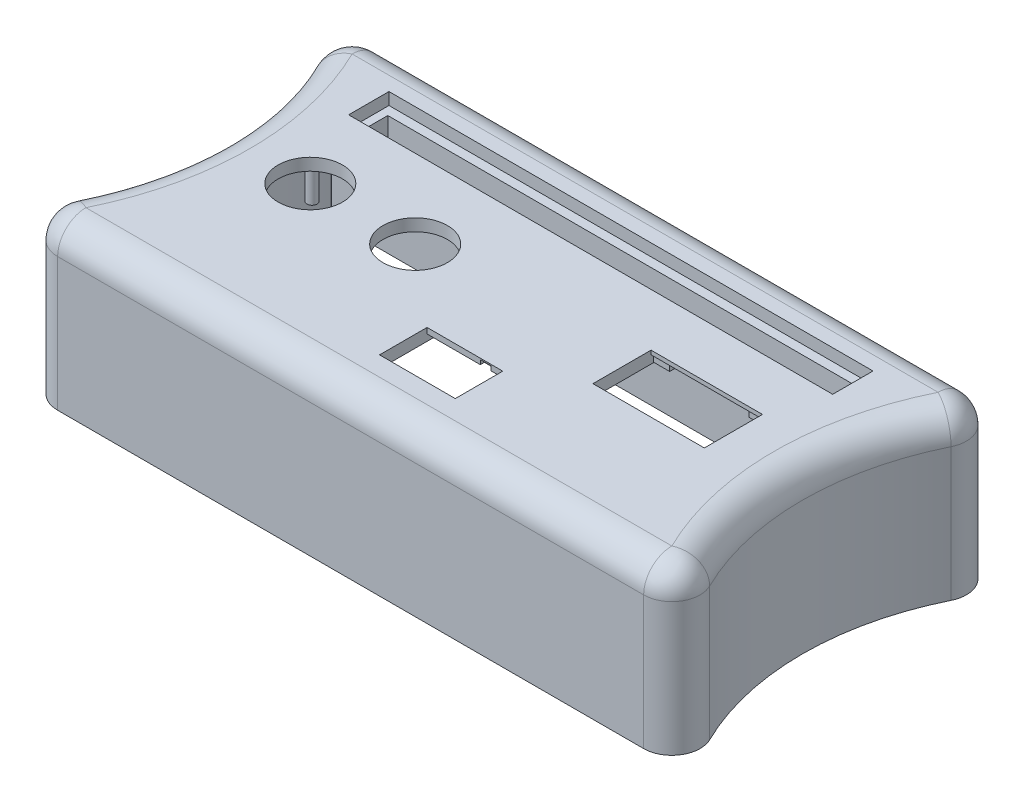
ISO-10303-21;
HEADER;
FILE_DESCRIPTION(('STEP AP214'),'2;1');
FILE_NAME('part.step','',(''),(''),'','','');
FILE_SCHEMA(('AUTOMOTIVE_DESIGN { 1 0 10303 214 1 1 1 1 }'));
ENDSEC;
DATA;
#1=APPLICATION_CONTEXT('core data for automotive mechanical design processes');
#2=APPLICATION_PROTOCOL_DEFINITION('international standard','automotive_design',2000,#1);
#3=PRODUCT_CONTEXT('',#1,'mechanical');
#4=PRODUCT('Part','Part','',(#3));
#5=PRODUCT_RELATED_PRODUCT_CATEGORY('part','',(#4));
#6=PRODUCT_DEFINITION_FORMATION('','',#4);
#7=PRODUCT_DEFINITION_CONTEXT('part definition',#1,'design');
#8=PRODUCT_DEFINITION('design','',#6,#7);
#9=PRODUCT_DEFINITION_SHAPE('','',#8);
#10=(LENGTH_UNIT() NAMED_UNIT(*) SI_UNIT(.MILLI.,.METRE.));
#11=(NAMED_UNIT(*) PLANE_ANGLE_UNIT() SI_UNIT($,.RADIAN.));
#12=(NAMED_UNIT(*) SI_UNIT($,.STERADIAN.) SOLID_ANGLE_UNIT());
#13=UNCERTAINTY_MEASURE_WITH_UNIT(LENGTH_MEASURE(1.E-05),#10,'distance_accuracy_value','');
#14=(GEOMETRIC_REPRESENTATION_CONTEXT(3) GLOBAL_UNCERTAINTY_ASSIGNED_CONTEXT((#13)) GLOBAL_UNIT_ASSIGNED_CONTEXT((#10,
#11,#12)) REPRESENTATION_CONTEXT('',''));
#15=CARTESIAN_POINT('',(0.,0.,0.));
#16=DIRECTION('',(0.,0.,1.));
#17=DIRECTION('',(1.,0.,0.));
#18=AXIS2_PLACEMENT_3D('',#15,#16,#17);
#19=CARTESIAN_POINT('',(0.,37.,0.));
#20=DIRECTION('',(0.,-1.,0.));
#21=DIRECTION('',(0.,0.,-1.));
#22=AXIS2_PLACEMENT_3D('',#19,#20,#21);
#23=PLANE('',#22);
#24=DIRECTION('',(-1.,0.,0.));
#25=VECTOR('',#24,1.);
#26=CARTESIAN_POINT('',(139.919865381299,37.,-29.5001615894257));
#27=LINE('',#26,#25);
#28=CARTESIAN_POINT('',(60.0000015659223,37.,-29.5001615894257));
#29=VERTEX_POINT('',#28);
#30=CARTESIAN_POINT('',(-59.9999984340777,37.,-29.5001615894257));
#31=VERTEX_POINT('',#30);
#32=EDGE_CURVE('E1160',#29,#31,#27,.T.);
#33=ORIENTED_EDGE('',*,*,#32,.T.);
#34=DIRECTION('',(0.,0.,1.));
#35=VECTOR('',#34,1.);
#36=CARTESIAN_POINT('',(-59.9999984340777,37.,0.));
#37=LINE('',#36,#35);
#38=CARTESIAN_POINT('',(-59.9999984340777,37.,-19.5001615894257));
#39=VERTEX_POINT('',#38);
#40=EDGE_CURVE('E1164',#31,#39,#37,.T.);
#41=ORIENTED_EDGE('',*,*,#40,.T.);
#42=DIRECTION('',(1.,0.,0.));
#43=VECTOR('',#42,1.);
#44=CARTESIAN_POINT('',(139.919865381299,37.,-19.5001615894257));
#45=LINE('',#44,#43);
#46=CARTESIAN_POINT('',(60.0000015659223,37.,-19.5001615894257));
#47=VERTEX_POINT('',#46);
#48=EDGE_CURVE('E1152',#39,#47,#45,.T.);
#49=ORIENTED_EDGE('',*,*,#48,.T.);
#50=DIRECTION('',(0.,0.,-1.));
#51=VECTOR('',#50,1.);
#52=CARTESIAN_POINT('',(60.0000015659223,37.,0.));
#53=LINE('',#52,#51);
#54=EDGE_CURVE('E1156',#47,#29,#53,.T.);
#55=ORIENTED_EDGE('',*,*,#54,.T.);
#56=EDGE_LOOP('',(#33,#41,#49,#55));
#57=FACE_BOUND('',#56,.T.);
#58=DIRECTION('',(0.,0.,1.));
#59=VECTOR('',#58,1.);
#60=CARTESIAN_POINT('',(-57.9999984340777,37.,-27.2001615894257));
#61=LINE('',#60,#59);
#62=CARTESIAN_POINT('',(-57.9999984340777,37.,-27.2001615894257));
#63=VERTEX_POINT('',#62);
#64=CARTESIAN_POINT('',(-57.9999984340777,37.,-21.8001615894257));
#65=VERTEX_POINT('',#64);
#66=EDGE_CURVE('E444',#63,#65,#61,.T.);
#67=ORIENTED_EDGE('',*,*,#66,.F.);
#68=DIRECTION('',(-1.,0.,0.));
#69=VECTOR('',#68,1.);
#70=CARTESIAN_POINT('',(-57.9999984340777,37.,-27.2001615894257));
#71=LINE('',#70,#69);
#72=CARTESIAN_POINT('',(58.0000015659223,37.,-27.2001615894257));
#73=VERTEX_POINT('',#72);
#74=EDGE_CURVE('E464',#73,#63,#71,.T.);
#75=ORIENTED_EDGE('',*,*,#74,.F.);
#76=DIRECTION('',(0.,0.,-1.));
#77=VECTOR('',#76,1.);
#78=CARTESIAN_POINT('',(58.0000015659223,37.,-27.2001615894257));
#79=LINE('',#78,#77);
#80=CARTESIAN_POINT('',(58.0000015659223,37.,-21.8001615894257));
#81=VERTEX_POINT('',#80);
#82=EDGE_CURVE('E63',#81,#73,#79,.T.);
#83=ORIENTED_EDGE('',*,*,#82,.F.);
#84=DIRECTION('',(1.,0.,0.));
#85=VECTOR('',#84,1.);
#86=CARTESIAN_POINT('',(-57.9999984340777,37.,-21.8001615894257));
#87=LINE('',#86,#85);
#88=EDGE_CURVE('E476',#65,#81,#87,.T.);
#89=ORIENTED_EDGE('',*,*,#88,.F.);
#90=EDGE_LOOP('',(#67,#75,#83,#89));
#91=FACE_BOUND('',#90,.T.);
#92=ADVANCED_FACE('F47',(#57,#91),#23,.F.);
#93=CARTESIAN_POINT('',(139.919865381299,37.,0.));
#94=DIRECTION('',(0.,1.,0.));
#95=DIRECTION('',(0.,0.,1.));
#96=AXIS2_PLACEMENT_3D('',#93,#94,#95);
#97=PLANE('',#96);
#98=DIRECTION('',(1.,0.,0.));
#99=VECTOR('',#98,1.);
#100=CARTESIAN_POINT('',(139.919865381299,37.,33.));
#101=LINE('',#100,#99);
#102=CARTESIAN_POINT('',(-72.6340015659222,37.,33.));
#103=VERTEX_POINT('',#102);
#104=CARTESIAN_POINT('',(72.6340015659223,37.,33.));
#105=VERTEX_POINT('',#104);
#106=EDGE_CURVE('E891',#103,#105,#101,.T.);
#107=ORIENTED_EDGE('',*,*,#106,.F.);
#108=CARTESIAN_POINT('',(-139.919865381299,37.,0.));
#109=DIRECTION('',(0.,1.,0.));
#110=DIRECTION('',(0.,0.,1.));
#111=AXIS2_PLACEMENT_3D('',#108,#109,#110);
#112=CIRCLE('',#111,74.942561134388);
#113=CARTESIAN_POINT('',(-72.6340015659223,37.,-33.));
#114=VERTEX_POINT('',#113);
#115=EDGE_CURVE('E899',#114,#103,#112,.F.);
#116=ORIENTED_EDGE('',*,*,#115,.F.);
#117=DIRECTION('',(1.,0.,0.));
#118=VECTOR('',#117,1.);
#119=CARTESIAN_POINT('',(139.919865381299,37.,-33.));
#120=LINE('',#119,#118);
#121=CARTESIAN_POINT('',(72.6340015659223,37.,-33.));
#122=VERTEX_POINT('',#121);
#123=EDGE_CURVE('E900',#122,#114,#120,.F.);
#124=ORIENTED_EDGE('',*,*,#123,.F.);
#125=CARTESIAN_POINT('',(139.919865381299,37.,0.));
#126=DIRECTION('',(0.,1.,0.));
#127=DIRECTION('',(0.,0.,1.));
#128=AXIS2_PLACEMENT_3D('',#125,#126,#127);
#129=CIRCLE('',#128,74.942561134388);
#130=EDGE_CURVE('E878',#105,#122,#129,.F.);
#131=ORIENTED_EDGE('',*,*,#130,.F.);
#132=EDGE_LOOP('',(#107,#116,#124,#131));
#133=FACE_BOUND('',#132,.T.);
#134=DIRECTION('',(0.,0.,1.));
#135=VECTOR('',#134,1.);
#136=CARTESIAN_POINT('',(28.,37.,0.));
#137=LINE('',#136,#135);
#138=CARTESIAN_POINT('',(28.,37.,-11.0891979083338));
#139=VERTEX_POINT('',#138);
#140=CARTESIAN_POINT('',(28.,37.,16.7108020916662));
#141=VERTEX_POINT('',#140);
#142=EDGE_CURVE('E1126',#139,#141,#137,.T.);
#143=ORIENTED_EDGE('',*,*,#142,.T.);
#144=DIRECTION('',(-1.,0.,0.));
#145=VECTOR('',#144,1.);
#146=CARTESIAN_POINT('',(28.,37.,16.7108020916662));
#147=LINE('',#146,#145);
#148=CARTESIAN_POINT('',(55.61,37.,16.7108020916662));
#149=VERTEX_POINT('',#148);
#150=EDGE_CURVE('E742',#149,#141,#147,.T.);
#151=ORIENTED_EDGE('',*,*,#150,.F.);
#152=DIRECTION('',(0.,0.,-1.));
#153=VECTOR('',#152,1.);
#154=CARTESIAN_POINT('',(55.61,37.,0.));
#155=LINE('',#154,#153);
#156=CARTESIAN_POINT('',(55.61,37.,-11.0891979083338));
#157=VERTEX_POINT('',#156);
#158=EDGE_CURVE('E1110',#149,#157,#155,.T.);
#159=ORIENTED_EDGE('',*,*,#158,.T.);
#160=DIRECTION('',(1.,0.,0.));
#161=VECTOR('',#160,1.);
#162=CARTESIAN_POINT('',(28.,37.,-11.0891979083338));
#163=LINE('',#162,#161);
#164=EDGE_CURVE('E705',#139,#157,#163,.T.);
#165=ORIENTED_EDGE('',*,*,#164,.F.);
#166=EDGE_LOOP('',(#143,#151,#159,#165));
#167=FACE_BOUND('',#166,.T.);
#168=CARTESIAN_POINT('',(-50.,37.,0.));
#169=DIRECTION('',(0.,1.,0.));
#170=DIRECTION('',(0.,0.,1.));
#171=AXIS2_PLACEMENT_3D('',#168,#169,#170);
#172=CIRCLE('',#171,7.985);
#173=CARTESIAN_POINT('',(-50.,37.,7.985));
#174=VERTEX_POINT('',#173);
#175=EDGE_CURVE('E798',#174,#174,#172,.T.);
#176=ORIENTED_EDGE('',*,*,#175,.T.);
#177=EDGE_LOOP('',(#176));
#178=FACE_BOUND('',#177,.T.);
#179=CARTESIAN_POINT('',(-24.,37.,0.));
#180=DIRECTION('',(0.,1.,0.));
#181=DIRECTION('',(0.,0.,1.));
#182=AXIS2_PLACEMENT_3D('',#179,#180,#181);
#183=CIRCLE('',#182,7.985);
#184=CARTESIAN_POINT('',(-24.,37.,7.985));
#185=VERTEX_POINT('',#184);
#186=EDGE_CURVE('E954',#185,#185,#183,.T.);
#187=ORIENTED_EDGE('',*,*,#186,.T.);
#188=EDGE_LOOP('',(#187));
#189=FACE_BOUND('',#188,.T.);
#190=DIRECTION('',(-1.,0.,0.));
#191=VECTOR('',#190,1.);
#192=CARTESIAN_POINT('',(139.919865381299,37.,13.82));
#193=LINE('',#192,#191);
#194=CARTESIAN_POINT('',(14.1359984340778,37.,13.82));
#195=VERTEX_POINT('',#194);
#196=CARTESIAN_POINT('',(-4.63400156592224,37.,13.82));
#197=VERTEX_POINT('',#196);
#198=EDGE_CURVE('E1144',#195,#197,#193,.T.);
#199=ORIENTED_EDGE('',*,*,#198,.T.);
#200=DIRECTION('',(0.,0.,1.));
#201=VECTOR('',#200,1.);
#202=CARTESIAN_POINT('',(-4.63400156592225,37.,0.));
#203=LINE('',#202,#201);
#204=CARTESIAN_POINT('',(-4.63400156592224,37.,28.2));
#205=VERTEX_POINT('',#204);
#206=EDGE_CURVE('E1148',#197,#205,#203,.T.);
#207=ORIENTED_EDGE('',*,*,#206,.T.);
#208=DIRECTION('',(1.,0.,0.));
#209=VECTOR('',#208,1.);
#210=CARTESIAN_POINT('',(139.919865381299,37.,28.2));
#211=LINE('',#210,#209);
#212=CARTESIAN_POINT('',(14.1359984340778,37.,28.2));
#213=VERTEX_POINT('',#212);
#214=EDGE_CURVE('E1130',#205,#213,#211,.T.);
#215=ORIENTED_EDGE('',*,*,#214,.T.);
#216=DIRECTION('',(0.,0.,-1.));
#217=VECTOR('',#216,1.);
#218=CARTESIAN_POINT('',(14.1359984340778,37.,0.));
#219=LINE('',#218,#217);
#220=EDGE_CURVE('E1140',#213,#195,#219,.T.);
#221=ORIENTED_EDGE('',*,*,#220,.T.);
#222=EDGE_LOOP('',(#199,#207,#215,#221));
#223=FACE_BOUND('',#222,.T.);
#224=CARTESIAN_POINT('',(-15.972624,37.,8.500338));
#225=DIRECTION('',(0.,1.,0.));
#226=DIRECTION('',(0.,0.,1.));
#227=AXIS2_PLACEMENT_3D('',#224,#225,#226);
#228=CIRCLE('',#227,1.263338);
#229=CARTESIAN_POINT('',(-15.972624,37.,9.763676));
#230=VERTEX_POINT('',#229);
#231=EDGE_CURVE('E1168',#230,#230,#228,.F.);
#232=ORIENTED_EDGE('',*,*,#231,.F.);
#233=EDGE_LOOP('',(#232));
#234=FACE_BOUND('',#233,.T.);
#235=CARTESIAN_POINT('',(-16.01597,37.,-8.495881));
#236=DIRECTION('',(0.,1.,0.));
#237=DIRECTION('',(0.,0.,1.));
#238=AXIS2_PLACEMENT_3D('',#235,#236,#237);
#239=CIRCLE('',#238,1.263338);
#240=CARTESIAN_POINT('',(-16.01597,37.,-7.232543));
#241=VERTEX_POINT('',#240);
#242=EDGE_CURVE('E1172',#241,#241,#239,.F.);
#243=ORIENTED_EDGE('',*,*,#242,.F.);
#244=EDGE_LOOP('',(#243));
#245=FACE_BOUND('',#244,.T.);
#246=CARTESIAN_POINT('',(-58.009512,37.,-8.435665));
#247=DIRECTION('',(0.,1.,0.));
#248=DIRECTION('',(0.,0.,1.));
#249=AXIS2_PLACEMENT_3D('',#246,#247,#248);
#250=CIRCLE('',#249,1.26333800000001);
#251=CARTESIAN_POINT('',(-58.009512,37.,-7.17232699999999));
#252=VERTEX_POINT('',#251);
#253=EDGE_CURVE('E1176',#252,#252,#250,.F.);
#254=ORIENTED_EDGE('',*,*,#253,.F.);
#255=EDGE_LOOP('',(#254));
#256=FACE_BOUND('',#255,.T.);
#257=CARTESIAN_POINT('',(-57.980045,37.,8.57921));
#258=DIRECTION('',(0.,1.,0.));
#259=DIRECTION('',(0.,0.,1.));
#260=AXIS2_PLACEMENT_3D('',#257,#258,#259);
#261=CIRCLE('',#260,1.263338);
#262=CARTESIAN_POINT('',(-57.980045,37.,9.842548));
#263=VERTEX_POINT('',#262);
#264=EDGE_CURVE('E56',#263,#263,#261,.F.);
#265=ORIENTED_EDGE('',*,*,#264,.F.);
#266=EDGE_LOOP('',(#265));
#267=FACE_BOUND('',#266,.T.);
#268=DIRECTION('',(0.,0.,-1.));
#269=VECTOR('',#268,1.);
#270=CARTESIAN_POINT('',(-62.3818346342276,37.,-17.6));
#271=LINE('',#270,#269);
#272=CARTESIAN_POINT('',(-62.3818346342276,37.,-17.6));
#273=VERTEX_POINT('',#272);
#274=CARTESIAN_POINT('',(-62.3818346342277,37.,-31.6));
#275=VERTEX_POINT('',#274);
#276=EDGE_CURVE('E484',#273,#275,#271,.T.);
#277=ORIENTED_EDGE('',*,*,#276,.F.);
#278=DIRECTION('',(-1.,0.,0.));
#279=VECTOR('',#278,1.);
#280=CARTESIAN_POINT('',(-62.3818346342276,37.,-17.6));
#281=LINE('',#280,#279);
#282=CARTESIAN_POINT('',(62.038133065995,37.,-17.6));
#283=VERTEX_POINT('',#282);
#284=EDGE_CURVE('E495',#283,#273,#281,.T.);
#285=ORIENTED_EDGE('',*,*,#284,.F.);
#286=DIRECTION('',(0.,0.,1.));
#287=VECTOR('',#286,1.);
#288=CARTESIAN_POINT('',(62.038133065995,37.,-17.6));
#289=LINE('',#288,#287);
#290=CARTESIAN_POINT('',(62.038133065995,37.,-31.6));
#291=VERTEX_POINT('',#290);
#292=EDGE_CURVE('E510',#291,#283,#289,.T.);
#293=ORIENTED_EDGE('',*,*,#292,.F.);
#294=DIRECTION('',(1.,0.,0.));
#295=VECTOR('',#294,1.);
#296=CARTESIAN_POINT('',(-62.3818346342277,37.,-31.6));
#297=LINE('',#296,#295);
#298=EDGE_CURVE('E71',#275,#291,#297,.T.);
#299=ORIENTED_EDGE('',*,*,#298,.F.);
#300=EDGE_LOOP('',(#277,#285,#293,#299));
#301=FACE_BOUND('',#300,.T.);
#302=ADVANCED_FACE('F1185',(#133,#167,#178,#189,#223,#234,#245,#256,#267,#301),#97,.F.);
#303=CARTESIAN_POINT('',(-4.49900156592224,38.6,28.16));
#304=DIRECTION('',(0.,-1.,0.));
#305=DIRECTION('',(0.,0.,-1.));
#306=AXIS2_PLACEMENT_3D('',#303,#304,#305);
#307=PLANE('',#306);
#308=DIRECTION('',(0.,0.,1.));
#309=VECTOR('',#308,1.);
#310=CARTESIAN_POINT('',(8.56599843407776,38.6,10.9045240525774));
#311=LINE('',#310,#309);
#312=CARTESIAN_POINT('',(8.56599843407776,38.6,13.82));
#313=VERTEX_POINT('',#312);
#314=CARTESIAN_POINT('',(8.56599843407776,38.6,16.42));
#315=VERTEX_POINT('',#314);
#316=EDGE_CURVE('E557',#313,#315,#311,.T.);
#317=ORIENTED_EDGE('',*,*,#316,.T.);
#318=DIRECTION('',(1.,0.,0.));
#319=VECTOR('',#318,1.);
#320=CARTESIAN_POINT('',(-4.63400156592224,38.6,16.42));
#321=LINE('',#320,#319);
#322=CARTESIAN_POINT('',(-4.63400156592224,38.6,16.42));
#323=VERTEX_POINT('',#322);
#324=EDGE_CURVE('E572',#323,#315,#321,.T.);
#325=ORIENTED_EDGE('',*,*,#324,.F.);
#326=DIRECTION('',(0.,0.,1.));
#327=VECTOR('',#326,1.);
#328=CARTESIAN_POINT('',(-4.63400156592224,38.6,13.82));
#329=LINE('',#328,#327);
#330=CARTESIAN_POINT('',(-4.63400156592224,38.6,13.82));
#331=VERTEX_POINT('',#330);
#332=EDGE_CURVE('E577',#331,#323,#329,.T.);
#333=ORIENTED_EDGE('',*,*,#332,.F.);
#334=DIRECTION('',(-1.,0.,0.));
#335=VECTOR('',#334,1.);
#336=CARTESIAN_POINT('',(-4.63400156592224,38.6,13.82));
#337=LINE('',#336,#335);
#338=EDGE_CURVE('E586',#313,#331,#337,.T.);
#339=ORIENTED_EDGE('',*,*,#338,.F.);
#340=EDGE_LOOP('',(#317,#325,#333,#339));
#341=FACE_BOUND('',#340,.T.);
#342=ADVANCED_FACE('F1187',(#341),#307,.T.);
#343=CARTESIAN_POINT('',(55.61,0.,-6.46919790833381));
#344=DIRECTION('',(1.,0.,0.));
#345=DIRECTION('',(0.,0.,-1.));
#346=AXIS2_PLACEMENT_3D('',#343,#344,#345);
#347=PLANE('',#346);
#348=DIRECTION('',(0.,1.,0.));
#349=VECTOR('',#348,1.);
#350=CARTESIAN_POINT('',(55.61,31.4431457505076,-7.08919790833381));
#351=LINE('',#350,#349);
#352=CARTESIAN_POINT('',(55.61,37.1,-7.08919790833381));
#353=VERTEX_POINT('',#352);
#354=CARTESIAN_POINT('',(55.61,39.,-7.08919790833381));
#355=VERTEX_POINT('',#354);
#356=EDGE_CURVE('E607',#353,#355,#351,.T.);
#357=ORIENTED_EDGE('',*,*,#356,.F.);
#358=DIRECTION('',(0.,0.,1.));
#359=VECTOR('',#358,1.);
#360=CARTESIAN_POINT('',(55.61,37.1,-11.0891979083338));
#361=LINE('',#360,#359);
#362=CARTESIAN_POINT('',(55.61,37.1,-11.0891979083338));
#363=VERTEX_POINT('',#362);
#364=EDGE_CURVE('E613',#363,#353,#361,.T.);
#365=ORIENTED_EDGE('',*,*,#364,.F.);
#366=DIRECTION('',(0.,-1.,0.));
#367=VECTOR('',#366,1.);
#368=CARTESIAN_POINT('',(55.61,39.,-11.0891979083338));
#369=LINE('',#368,#367);
#370=EDGE_CURVE('E753',#363,#157,#369,.T.);
#371=ORIENTED_EDGE('',*,*,#370,.T.);
#372=ORIENTED_EDGE('',*,*,#158,.F.);
#373=DIRECTION('',(0.,-1.,0.));
#374=VECTOR('',#373,1.);
#375=CARTESIAN_POINT('',(55.61,39.,16.7108020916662));
#376=LINE('',#375,#374);
#377=CARTESIAN_POINT('',(55.61,37.1,16.7108020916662));
#378=VERTEX_POINT('',#377);
#379=EDGE_CURVE('E750',#378,#149,#376,.T.);
#380=ORIENTED_EDGE('',*,*,#379,.F.);
#381=DIRECTION('',(0.,0.,1.));
#382=VECTOR('',#381,1.);
#383=CARTESIAN_POINT('',(55.61,37.1,16.7108020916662));
#384=LINE('',#383,#382);
#385=CARTESIAN_POINT('',(55.61,37.1,12.7108020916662));
#386=VERTEX_POINT('',#385);
#387=EDGE_CURVE('E644',#386,#378,#384,.T.);
#388=ORIENTED_EDGE('',*,*,#387,.F.);
#389=DIRECTION('',(0.,1.,0.));
#390=VECTOR('',#389,1.);
#391=CARTESIAN_POINT('',(55.61,31.4431457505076,12.7108020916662));
#392=LINE('',#391,#390);
#393=CARTESIAN_POINT('',(55.61,39.,12.7108020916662));
#394=VERTEX_POINT('',#393);
#395=EDGE_CURVE('E628',#386,#394,#392,.T.);
#396=ORIENTED_EDGE('',*,*,#395,.T.);
#397=DIRECTION('',(0.,0.,1.));
#398=VECTOR('',#397,1.);
#399=CARTESIAN_POINT('',(55.61,39.,16.7108020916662));
#400=LINE('',#399,#398);
#401=CARTESIAN_POINT('',(55.61,39.,7.93080209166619));
#402=VERTEX_POINT('',#401);
#403=EDGE_CURVE('E731',#402,#394,#400,.T.);
#404=ORIENTED_EDGE('',*,*,#403,.F.);
#405=DIRECTION('',(0.,1.,0.));
#406=VECTOR('',#405,1.);
#407=CARTESIAN_POINT('',(55.61,0.,7.93080209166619));
#408=LINE('',#407,#406);
#409=CARTESIAN_POINT('',(55.61,40.,7.93080209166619));
#410=VERTEX_POINT('',#409);
#411=EDGE_CURVE('E842',#402,#410,#408,.T.);
#412=ORIENTED_EDGE('',*,*,#411,.T.);
#413=DIRECTION('',(0.,0.,-1.));
#414=VECTOR('',#413,1.);
#415=CARTESIAN_POINT('',(55.61,40.,-6.46919790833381));
#416=LINE('',#415,#414);
#417=CARTESIAN_POINT('',(55.61,40.,-6.46919790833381));
#418=VERTEX_POINT('',#417);
#419=EDGE_CURVE('E854',#410,#418,#416,.T.);
#420=ORIENTED_EDGE('',*,*,#419,.T.);
#421=DIRECTION('',(0.,1.,0.));
#422=VECTOR('',#421,1.);
#423=CARTESIAN_POINT('',(55.61,0.,-6.46919790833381));
#424=LINE('',#423,#422);
#425=CARTESIAN_POINT('',(55.61,39.,-6.46919790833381));
#426=VERTEX_POINT('',#425);
#427=EDGE_CURVE('E845',#426,#418,#424,.T.);
#428=ORIENTED_EDGE('',*,*,#427,.F.);
#429=EDGE_CURVE('E732',#355,#426,#400,.T.);
#430=ORIENTED_EDGE('',*,*,#429,.F.);
#431=EDGE_LOOP('',(#357,#365,#371,#372,#380,#388,#396,#404,#412,#420,#428,#430));
#432=FACE_BOUND('',#431,.T.);
#433=ADVANCED_FACE('F1419',(#432),#347,.F.);
#434=CARTESIAN_POINT('',(0.,39.,0.));
#435=DIRECTION('',(0.,1.,0.));
#436=DIRECTION('',(0.,0.,1.));
#437=AXIS2_PLACEMENT_3D('',#434,#435,#436);
#438=PLANE('',#437);
#439=DIRECTION('',(-1.,0.,0.));
#440=VECTOR('',#439,1.);
#441=CARTESIAN_POINT('',(55.61,39.,-7.08919790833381));
#442=LINE('',#441,#440);
#443=CARTESIAN_POINT('',(51.61,39.,-7.08919790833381));
#444=VERTEX_POINT('',#443);
#445=EDGE_CURVE('E606',#355,#444,#442,.T.);
#446=ORIENTED_EDGE('',*,*,#445,.F.);
#447=ORIENTED_EDGE('',*,*,#429,.T.);
#448=DIRECTION('',(1.,0.,0.));
#449=VECTOR('',#448,1.);
#450=CARTESIAN_POINT('',(28.,39.,-6.46919790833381));
#451=LINE('',#450,#449);
#452=CARTESIAN_POINT('',(28.,39.,-6.46919790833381));
#453=VERTEX_POINT('',#452);
#454=EDGE_CURVE('E749',#453,#426,#451,.T.);
#455=ORIENTED_EDGE('',*,*,#454,.F.);
#456=DIRECTION('',(0.,0.,-1.));
#457=VECTOR('',#456,1.);
#458=CARTESIAN_POINT('',(28.,39.,-11.0891979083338));
#459=LINE('',#458,#457);
#460=CARTESIAN_POINT('',(28.,39.,-7.08919790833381));
#461=VERTEX_POINT('',#460);
#462=EDGE_CURVE('E727',#453,#461,#459,.T.);
#463=ORIENTED_EDGE('',*,*,#462,.T.);
#464=DIRECTION('',(-1.,0.,0.));
#465=VECTOR('',#464,1.);
#466=CARTESIAN_POINT('',(28.,39.,-7.08919790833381));
#467=LINE('',#466,#465);
#468=CARTESIAN_POINT('',(32.,39.,-7.08919790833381));
#469=VERTEX_POINT('',#468);
#470=EDGE_CURVE('E691',#469,#461,#467,.T.);
#471=ORIENTED_EDGE('',*,*,#470,.F.);
#472=DIRECTION('',(0.,0.,1.));
#473=VECTOR('',#472,1.);
#474=CARTESIAN_POINT('',(32.,39.,-11.0891979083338));
#475=LINE('',#474,#473);
#476=CARTESIAN_POINT('',(32.,39.,-11.0891979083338));
#477=VERTEX_POINT('',#476);
#478=EDGE_CURVE('E696',#477,#469,#475,.T.);
#479=ORIENTED_EDGE('',*,*,#478,.F.);
#480=DIRECTION('',(1.,0.,0.));
#481=VECTOR('',#480,1.);
#482=CARTESIAN_POINT('',(28.,39.,-11.0891979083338));
#483=LINE('',#482,#481);
#484=CARTESIAN_POINT('',(51.61,39.,-11.0891979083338));
#485=VERTEX_POINT('',#484);
#486=EDGE_CURVE('E726',#477,#485,#483,.T.);
#487=ORIENTED_EDGE('',*,*,#486,.T.);
#488=DIRECTION('',(0.,0.,-1.));
#489=VECTOR('',#488,1.);
#490=CARTESIAN_POINT('',(51.61,39.,-11.0891979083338));
#491=LINE('',#490,#489);
#492=EDGE_CURVE('E601',#444,#485,#491,.T.);
#493=ORIENTED_EDGE('',*,*,#492,.F.);
#494=EDGE_LOOP('',(#446,#447,#455,#463,#471,#479,#487,#493));
#495=FACE_BOUND('',#494,.T.);
#496=ADVANCED_FACE('F1616',(#495),#438,.F.);
#497=CARTESIAN_POINT('',(28.,39.,-11.0891979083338));
#498=DIRECTION('',(0.,0.,-1.));
#499=DIRECTION('',(-1.,0.,0.));
#500=AXIS2_PLACEMENT_3D('',#497,#498,#499);
#501=PLANE('',#500);
#502=DIRECTION('',(0.,1.,0.));
#503=VECTOR('',#502,1.);
#504=CARTESIAN_POINT('',(51.61,31.4431457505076,-11.0891979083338));
#505=LINE('',#504,#503);
#506=CARTESIAN_POINT('',(51.61,37.1,-11.0891979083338));
#507=VERTEX_POINT('',#506);
#508=EDGE_CURVE('E597',#507,#485,#505,.T.);
#509=ORIENTED_EDGE('',*,*,#508,.T.);
#510=ORIENTED_EDGE('',*,*,#486,.F.);
#511=DIRECTION('',(0.,1.,0.));
#512=VECTOR('',#511,1.);
#513=CARTESIAN_POINT('',(32.,31.4431457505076,-11.0891979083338));
#514=LINE('',#513,#512);
#515=CARTESIAN_POINT('',(32.,37.1,-11.0891979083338));
#516=VERTEX_POINT('',#515);
#517=EDGE_CURVE('E700',#516,#477,#514,.T.);
#518=ORIENTED_EDGE('',*,*,#517,.F.);
#519=DIRECTION('',(1.,0.,0.));
#520=VECTOR('',#519,1.);
#521=CARTESIAN_POINT('',(28.,37.1,-11.0891979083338));
#522=LINE('',#521,#520);
#523=CARTESIAN_POINT('',(28.,37.1,-11.0891979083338));
#524=VERTEX_POINT('',#523);
#525=EDGE_CURVE('E706',#524,#516,#522,.T.);
#526=ORIENTED_EDGE('',*,*,#525,.F.);
#527=DIRECTION('',(0.,-1.,0.));
#528=VECTOR('',#527,1.);
#529=CARTESIAN_POINT('',(28.,39.,-11.0891979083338));
#530=LINE('',#529,#528);
#531=EDGE_CURVE('E738',#524,#139,#530,.T.);
#532=ORIENTED_EDGE('',*,*,#531,.T.);
#533=ORIENTED_EDGE('',*,*,#164,.T.);
#534=ORIENTED_EDGE('',*,*,#370,.F.);
#535=DIRECTION('',(1.,0.,0.));
#536=VECTOR('',#535,1.);
#537=CARTESIAN_POINT('',(55.61,37.1,-11.0891979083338));
#538=LINE('',#537,#536);
#539=EDGE_CURVE('E602',#507,#363,#538,.T.);
#540=ORIENTED_EDGE('',*,*,#539,.F.);
#541=EDGE_LOOP('',(#509,#510,#518,#526,#532,#533,#534,#540));
#542=FACE_BOUND('',#541,.T.);
#543=ADVANCED_FACE('F1613',(#542),#501,.F.);
#544=DIRECTION('',(0.,0.,-1.));
#545=VECTOR('',#544,1.);
#546=CARTESIAN_POINT('',(51.61,39.,16.7108020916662));
#547=LINE('',#546,#545);
#548=CARTESIAN_POINT('',(51.61,39.,16.7108020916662));
#549=VERTEX_POINT('',#548);
#550=CARTESIAN_POINT('',(51.61,39.,12.7108020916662));
#551=VERTEX_POINT('',#550);
#552=EDGE_CURVE('E637',#549,#551,#547,.T.);
#553=ORIENTED_EDGE('',*,*,#552,.F.);
#554=DIRECTION('',(-1.,0.,0.));
#555=VECTOR('',#554,1.);
#556=CARTESIAN_POINT('',(28.,39.,16.7108020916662));
#557=LINE('',#556,#555);
#558=CARTESIAN_POINT('',(32.,39.,16.7108020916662));
#559=VERTEX_POINT('',#558);
#560=EDGE_CURVE('E735',#549,#559,#557,.T.);
#561=ORIENTED_EDGE('',*,*,#560,.T.);
#562=DIRECTION('',(0.,0.,1.));
#563=VECTOR('',#562,1.);
#564=CARTESIAN_POINT('',(32.,39.,16.7108020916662));
#565=LINE('',#564,#563);
#566=CARTESIAN_POINT('',(32.,39.,12.7108020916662));
#567=VERTEX_POINT('',#566);
#568=EDGE_CURVE('E663',#567,#559,#565,.T.);
#569=ORIENTED_EDGE('',*,*,#568,.F.);
#570=DIRECTION('',(1.,0.,0.));
#571=VECTOR('',#570,1.);
#572=CARTESIAN_POINT('',(28.,39.,12.7108020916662));
#573=LINE('',#572,#571);
#574=CARTESIAN_POINT('',(28.,39.,12.7108020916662));
#575=VERTEX_POINT('',#574);
#576=EDGE_CURVE('E668',#575,#567,#573,.T.);
#577=ORIENTED_EDGE('',*,*,#576,.F.);
#578=CARTESIAN_POINT('',(28.,39.,7.93080209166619));
#579=VERTEX_POINT('',#578);
#580=EDGE_CURVE('E723',#575,#579,#459,.T.);
#581=ORIENTED_EDGE('',*,*,#580,.T.);
#582=DIRECTION('',(-1.,0.,0.));
#583=VECTOR('',#582,1.);
#584=CARTESIAN_POINT('',(28.,39.,7.93080209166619));
#585=LINE('',#584,#583);
#586=EDGE_CURVE('E11',#402,#579,#585,.T.);
#587=ORIENTED_EDGE('',*,*,#586,.F.);
#588=ORIENTED_EDGE('',*,*,#403,.T.);
#589=DIRECTION('',(1.,0.,0.));
#590=VECTOR('',#589,1.);
#591=CARTESIAN_POINT('',(55.61,39.,12.7108020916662));
#592=LINE('',#591,#590);
#593=EDGE_CURVE('E638',#551,#394,#592,.T.);
#594=ORIENTED_EDGE('',*,*,#593,.F.);
#595=EDGE_LOOP('',(#553,#561,#569,#577,#581,#587,#588,#594));
#596=FACE_BOUND('',#595,.T.);
#597=ADVANCED_FACE('F1602',(#596),#438,.F.);
#598=CARTESIAN_POINT('',(28.,39.,16.7108020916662));
#599=DIRECTION('',(0.,0.,1.));
#600=DIRECTION('',(1.,0.,0.));
#601=AXIS2_PLACEMENT_3D('',#598,#599,#600);
#602=PLANE('',#601);
#603=DIRECTION('',(0.,1.,0.));
#604=VECTOR('',#603,1.);
#605=CARTESIAN_POINT('',(51.61,31.4431457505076,16.7108020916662));
#606=LINE('',#605,#604);
#607=CARTESIAN_POINT('',(51.61,37.1,16.7108020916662));
#608=VERTEX_POINT('',#607);
#609=EDGE_CURVE('E633',#608,#549,#606,.T.);
#610=ORIENTED_EDGE('',*,*,#609,.F.);
#611=DIRECTION('',(-1.,0.,0.));
#612=VECTOR('',#611,1.);
#613=CARTESIAN_POINT('',(55.61,37.1,16.7108020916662));
#614=LINE('',#613,#612);
#615=EDGE_CURVE('E647',#378,#608,#614,.T.);
#616=ORIENTED_EDGE('',*,*,#615,.F.);
#617=ORIENTED_EDGE('',*,*,#379,.T.);
#618=ORIENTED_EDGE('',*,*,#150,.T.);
#619=DIRECTION('',(0.,-1.,0.));
#620=VECTOR('',#619,1.);
#621=CARTESIAN_POINT('',(28.,39.,16.7108020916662));
#622=LINE('',#621,#620);
#623=CARTESIAN_POINT('',(28.,37.1,16.7108020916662));
#624=VERTEX_POINT('',#623);
#625=EDGE_CURVE('E746',#624,#141,#622,.T.);
#626=ORIENTED_EDGE('',*,*,#625,.F.);
#627=DIRECTION('',(-1.,0.,0.));
#628=VECTOR('',#627,1.);
#629=CARTESIAN_POINT('',(28.,37.1,16.7108020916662));
#630=LINE('',#629,#628);
#631=CARTESIAN_POINT('',(32.,37.1,16.7108020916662));
#632=VERTEX_POINT('',#631);
#633=EDGE_CURVE('E664',#632,#624,#630,.T.);
#634=ORIENTED_EDGE('',*,*,#633,.F.);
#635=DIRECTION('',(0.,1.,0.));
#636=VECTOR('',#635,1.);
#637=CARTESIAN_POINT('',(32.,31.4431457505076,16.7108020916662));
#638=LINE('',#637,#636);
#639=EDGE_CURVE('E659',#632,#559,#638,.T.);
#640=ORIENTED_EDGE('',*,*,#639,.T.);
#641=ORIENTED_EDGE('',*,*,#560,.F.);
#642=EDGE_LOOP('',(#610,#616,#617,#618,#626,#634,#640,#641));
#643=FACE_BOUND('',#642,.T.);
#644=ADVANCED_FACE('F1590',(#643),#602,.F.);
#645=CARTESIAN_POINT('',(28.,0.,-6.46919790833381));
#646=DIRECTION('',(-1.,0.,0.));
#647=DIRECTION('',(0.,0.,1.));
#648=AXIS2_PLACEMENT_3D('',#645,#646,#647);
#649=PLANE('',#648);
#650=DIRECTION('',(0.,1.,0.));
#651=VECTOR('',#650,1.);
#652=CARTESIAN_POINT('',(28.,31.4431457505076,12.7108020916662));
#653=LINE('',#652,#651);
#654=CARTESIAN_POINT('',(28.,37.1,12.7108020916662));
#655=VERTEX_POINT('',#654);
#656=EDGE_CURVE('E669',#655,#575,#653,.T.);
#657=ORIENTED_EDGE('',*,*,#656,.F.);
#658=DIRECTION('',(0.,0.,-1.));
#659=VECTOR('',#658,1.);
#660=CARTESIAN_POINT('',(28.,37.1,16.7108020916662));
#661=LINE('',#660,#659);
#662=EDGE_CURVE('E675',#624,#655,#661,.T.);
#663=ORIENTED_EDGE('',*,*,#662,.F.);
#664=ORIENTED_EDGE('',*,*,#625,.T.);
#665=ORIENTED_EDGE('',*,*,#142,.F.);
#666=ORIENTED_EDGE('',*,*,#531,.F.);
#667=DIRECTION('',(0.,0.,-1.));
#668=VECTOR('',#667,1.);
#669=CARTESIAN_POINT('',(28.,37.1,-11.0891979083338));
#670=LINE('',#669,#668);
#671=CARTESIAN_POINT('',(28.,37.1,-7.08919790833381));
#672=VERTEX_POINT('',#671);
#673=EDGE_CURVE('E710',#672,#524,#670,.T.);
#674=ORIENTED_EDGE('',*,*,#673,.F.);
#675=DIRECTION('',(0.,1.,0.));
#676=VECTOR('',#675,1.);
#677=CARTESIAN_POINT('',(28.,31.4431457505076,-7.08919790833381));
#678=LINE('',#677,#676);
#679=EDGE_CURVE('E672',#672,#461,#678,.T.);
#680=ORIENTED_EDGE('',*,*,#679,.T.);
#681=ORIENTED_EDGE('',*,*,#462,.F.);
#682=DIRECTION('',(0.,1.,0.));
#683=VECTOR('',#682,1.);
#684=CARTESIAN_POINT('',(28.,0.,-6.46919790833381));
#685=LINE('',#684,#683);
#686=CARTESIAN_POINT('',(28.,40.,-6.46919790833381));
#687=VERTEX_POINT('',#686);
#688=EDGE_CURVE('E848',#453,#687,#685,.T.);
#689=ORIENTED_EDGE('',*,*,#688,.T.);
#690=DIRECTION('',(0.,0.,1.));
#691=VECTOR('',#690,1.);
#692=CARTESIAN_POINT('',(28.,40.,-6.46919790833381));
#693=LINE('',#692,#691);
#694=CARTESIAN_POINT('',(28.,40.,7.93080209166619));
#695=VERTEX_POINT('',#694);
#696=EDGE_CURVE('E782',#687,#695,#693,.T.);
#697=ORIENTED_EDGE('',*,*,#696,.T.);
#698=DIRECTION('',(0.,1.,0.));
#699=VECTOR('',#698,1.);
#700=CARTESIAN_POINT('',(28.,0.,7.93080209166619));
#701=LINE('',#700,#699);
#702=EDGE_CURVE('E838',#579,#695,#701,.T.);
#703=ORIENTED_EDGE('',*,*,#702,.F.);
#704=ORIENTED_EDGE('',*,*,#580,.F.);
#705=EDGE_LOOP('',(#657,#663,#664,#665,#666,#674,#680,#681,#689,#697,#703,#704));
#706=FACE_BOUND('',#705,.T.);
#707=ADVANCED_FACE('F1584',(#706),#649,.F.);
#708=CARTESIAN_POINT('',(139.919865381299,0.,0.));
#709=DIRECTION('',(0.,1.,0.));
#710=DIRECTION('',(0.,0.,1.));
#711=AXIS2_PLACEMENT_3D('',#708,#709,#710);
#712=PLANE('',#711);
#713=DIRECTION('',(-1.,0.,0.));
#714=VECTOR('',#713,1.);
#715=CARTESIAN_POINT('',(-85.,0.,-40.));
#716=LINE('',#715,#714);
#717=CARTESIAN_POINT('',(72.6340015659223,0.,-40.));
#718=VERTEX_POINT('',#717);
#719=CARTESIAN_POINT('',(-72.6340015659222,0.,-40.));
#720=VERTEX_POINT('',#719);
#721=EDGE_CURVE('E1001',#718,#720,#716,.T.);
#722=ORIENTED_EDGE('',*,*,#721,.F.);
#723=CARTESIAN_POINT('',(72.6340015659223,0.,-33.));
#724=DIRECTION('',(0.,1.,0.));
#725=DIRECTION('',(0.,0.,1.));
#726=AXIS2_PLACEMENT_3D('',#723,#724,#725);
#727=CIRCLE('',#726,7.);
#728=CARTESIAN_POINT('',(78.9188287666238,0.,-29.9176393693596));
#729=VERTEX_POINT('',#728);
#730=EDGE_CURVE('E1089',#718,#729,#727,.F.);
#731=ORIENTED_EDGE('',*,*,#730,.T.);
#732=CARTESIAN_POINT('',(139.919865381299,0.,0.));
#733=DIRECTION('',(0.,-1.,0.));
#734=DIRECTION('',(0.,0.,1.));
#735=AXIS2_PLACEMENT_3D('',#732,#733,#734);
#736=CIRCLE('',#735,67.942561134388);
#737=CARTESIAN_POINT('',(78.9188287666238,0.,29.9176393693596));
#738=VERTEX_POINT('',#737);
#739=EDGE_CURVE('E997',#738,#729,#736,.T.);
#740=ORIENTED_EDGE('',*,*,#739,.F.);
#741=CARTESIAN_POINT('',(72.6340015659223,0.,33.));
#742=DIRECTION('',(0.,1.,0.));
#743=DIRECTION('',(0.,0.,1.));
#744=AXIS2_PLACEMENT_3D('',#741,#742,#743);
#745=CIRCLE('',#744,7.);
#746=CARTESIAN_POINT('',(72.6340015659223,0.,40.));
#747=VERTEX_POINT('',#746);
#748=EDGE_CURVE('E1086',#738,#747,#745,.F.);
#749=ORIENTED_EDGE('',*,*,#748,.T.);
#750=DIRECTION('',(1.,0.,0.));
#751=VECTOR('',#750,1.);
#752=CARTESIAN_POINT('',(-85.,0.,40.));
#753=LINE('',#752,#751);
#754=CARTESIAN_POINT('',(-72.6340015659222,0.,40.));
#755=VERTEX_POINT('',#754);
#756=EDGE_CURVE('E1010',#755,#747,#753,.T.);
#757=ORIENTED_EDGE('',*,*,#756,.F.);
#758=CARTESIAN_POINT('',(-72.6340015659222,0.,33.));
#759=DIRECTION('',(0.,1.,0.));
#760=DIRECTION('',(0.,0.,1.));
#761=AXIS2_PLACEMENT_3D('',#758,#759,#760);
#762=CIRCLE('',#761,7.);
#763=CARTESIAN_POINT('',(-78.9188287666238,0.,29.9176393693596));
#764=VERTEX_POINT('',#763);
#765=EDGE_CURVE('E1083',#755,#764,#762,.F.);
#766=ORIENTED_EDGE('',*,*,#765,.T.);
#767=CARTESIAN_POINT('',(-139.919865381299,0.,0.));
#768=DIRECTION('',(0.,-1.,0.));
#769=DIRECTION('',(0.,0.,-1.));
#770=AXIS2_PLACEMENT_3D('',#767,#768,#769);
#771=CIRCLE('',#770,67.942561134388);
#772=CARTESIAN_POINT('',(-78.9188287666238,0.,-29.9176393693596));
#773=VERTEX_POINT('',#772);
#774=EDGE_CURVE('E1006',#773,#764,#771,.T.);
#775=ORIENTED_EDGE('',*,*,#774,.F.);
#776=CARTESIAN_POINT('',(-72.6340015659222,0.,-33.));
#777=DIRECTION('',(0.,1.,0.));
#778=DIRECTION('',(0.,0.,1.));
#779=AXIS2_PLACEMENT_3D('',#776,#777,#778);
#780=CIRCLE('',#779,7.);
#781=EDGE_CURVE('E1080',#773,#720,#780,.F.);
#782=ORIENTED_EDGE('',*,*,#781,.T.);
#783=EDGE_LOOP('',(#722,#731,#740,#749,#757,#766,#775,#782));
#784=FACE_BOUND('',#783,.T.);
#785=CARTESIAN_POINT('',(72.6340015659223,0.,-33.));
#786=DIRECTION('',(0.,1.,0.));
#787=DIRECTION('',(0.,0.,1.));
#788=AXIS2_PLACEMENT_3D('',#785,#786,#787);
#789=CIRCLE('',#788,4.);
#790=CARTESIAN_POINT('',(72.6340015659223,0.,-37.));
#791=VERTEX_POINT('',#790);
#792=CARTESIAN_POINT('',(76.2253313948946,0.,-31.2386510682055));
#793=VERTEX_POINT('',#792);
#794=EDGE_CURVE('E881',#791,#793,#789,.F.);
#795=ORIENTED_EDGE('',*,*,#794,.F.);
#796=DIRECTION('',(-1.,0.,0.));
#797=VECTOR('',#796,1.);
#798=CARTESIAN_POINT('',(-85.,0.,-37.));
#799=LINE('',#798,#797);
#800=CARTESIAN_POINT('',(-72.6340015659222,0.,-37.));
#801=VERTEX_POINT('',#800);
#802=EDGE_CURVE('E976',#791,#801,#799,.T.);
#803=ORIENTED_EDGE('',*,*,#802,.T.);
#804=CARTESIAN_POINT('',(-72.6340015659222,0.,-33.));
#805=DIRECTION('',(0.,1.,0.));
#806=DIRECTION('',(0.,0.,1.));
#807=AXIS2_PLACEMENT_3D('',#804,#805,#806);
#808=CIRCLE('',#807,4.);
#809=CARTESIAN_POINT('',(-76.2253313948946,0.,-31.2386510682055));
#810=VERTEX_POINT('',#809);
#811=EDGE_CURVE('E963',#810,#801,#808,.F.);
#812=ORIENTED_EDGE('',*,*,#811,.F.);
#813=CARTESIAN_POINT('',(-139.919865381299,0.,0.));
#814=DIRECTION('',(0.,1.,0.));
#815=DIRECTION('',(0.,0.,1.));
#816=AXIS2_PLACEMENT_3D('',#813,#814,#815);
#817=CIRCLE('',#816,70.942561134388);
#818=CARTESIAN_POINT('',(-76.2253313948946,0.,31.2386510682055));
#819=VERTEX_POINT('',#818);
#820=EDGE_CURVE('E984',#810,#819,#817,.F.);
#821=ORIENTED_EDGE('',*,*,#820,.T.);
#822=CARTESIAN_POINT('',(-72.6340015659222,0.,33.));
#823=DIRECTION('',(0.,1.,0.));
#824=DIRECTION('',(0.,0.,1.));
#825=AXIS2_PLACEMENT_3D('',#822,#823,#824);
#826=CIRCLE('',#825,4.);
#827=CARTESIAN_POINT('',(-72.6340015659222,0.,37.));
#828=VERTEX_POINT('',#827);
#829=EDGE_CURVE('E980',#828,#819,#826,.F.);
#830=ORIENTED_EDGE('',*,*,#829,.F.);
#831=DIRECTION('',(1.,0.,0.));
#832=VECTOR('',#831,1.);
#833=CARTESIAN_POINT('',(-85.,0.,37.));
#834=LINE('',#833,#832);
#835=CARTESIAN_POINT('',(72.6340015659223,0.,37.));
#836=VERTEX_POINT('',#835);
#837=EDGE_CURVE('E904',#828,#836,#834,.T.);
#838=ORIENTED_EDGE('',*,*,#837,.T.);
#839=CARTESIAN_POINT('',(72.6340015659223,0.,33.));
#840=DIRECTION('',(0.,1.,0.));
#841=DIRECTION('',(0.,0.,1.));
#842=AXIS2_PLACEMENT_3D('',#839,#840,#841);
#843=CIRCLE('',#842,4.);
#844=CARTESIAN_POINT('',(76.2253313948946,0.,31.2386510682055));
#845=VERTEX_POINT('',#844);
#846=EDGE_CURVE('E977',#845,#836,#843,.F.);
#847=ORIENTED_EDGE('',*,*,#846,.F.);
#848=CARTESIAN_POINT('',(139.919865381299,0.,0.));
#849=DIRECTION('',(0.,1.,0.));
#850=DIRECTION('',(0.,0.,1.));
#851=AXIS2_PLACEMENT_3D('',#848,#849,#850);
#852=CIRCLE('',#851,70.942561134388);
#853=EDGE_CURVE('E972',#845,#793,#852,.F.);
#854=ORIENTED_EDGE('',*,*,#853,.T.);
#855=EDGE_LOOP('',(#795,#803,#812,#821,#830,#838,#847,#854));
#856=FACE_BOUND('',#855,.T.);
#857=ADVANCED_FACE('F1589',(#784,#856),#712,.F.);
#858=CARTESIAN_POINT('',(139.919865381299,40.,0.));
#859=DIRECTION('',(0.,-1.,0.));
#860=DIRECTION('',(0.,0.,-1.));
#861=AXIS2_PLACEMENT_3D('',#858,#859,#860);
#862=CYLINDRICAL_SURFACE('',#861,67.942561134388);
#863=ORIENTED_EDGE('',*,*,#739,.T.);
#864=DIRECTION('',(0.,-1.,0.));
#865=VECTOR('',#864,1.);
#866=CARTESIAN_POINT('',(78.9188287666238,40.,-29.9176393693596));
#867=LINE('',#866,#865);
#868=CARTESIAN_POINT('',(78.9188287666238,33.,-29.9176393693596));
#869=VERTEX_POINT('',#868);
#870=EDGE_CURVE('E1095',#729,#869,#867,.F.);
#871=ORIENTED_EDGE('',*,*,#870,.T.);
#872=CARTESIAN_POINT('',(139.919865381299,33.,0.));
#873=DIRECTION('',(0.,1.,0.));
#874=DIRECTION('',(0.,0.,1.));
#875=AXIS2_PLACEMENT_3D('',#872,#873,#874);
#876=CIRCLE('',#875,67.942561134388);
#877=CARTESIAN_POINT('',(78.9188287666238,33.,29.9176393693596));
#878=VERTEX_POINT('',#877);
#879=EDGE_CURVE('E1030',#869,#878,#876,.T.);
#880=ORIENTED_EDGE('',*,*,#879,.T.);
#881=DIRECTION('',(0.,-1.,0.));
#882=VECTOR('',#881,1.);
#883=CARTESIAN_POINT('',(78.9188287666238,40.,29.9176393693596));
#884=LINE('',#883,#882);
#885=EDGE_CURVE('E1092',#878,#738,#884,.T.);
#886=ORIENTED_EDGE('',*,*,#885,.T.);
#887=EDGE_LOOP('',(#863,#871,#880,#886));
#888=FACE_BOUND('',#887,.T.);
#889=ADVANCED_FACE('F1965',(#888),#862,.F.);
#890=CARTESIAN_POINT('',(-85.,40.,-40.));
#891=DIRECTION('',(0.,0.,1.));
#892=DIRECTION('',(1.,0.,0.));
#893=AXIS2_PLACEMENT_3D('',#890,#891,#892);
#894=PLANE('',#893);
#895=DIRECTION('',(-1.,0.,0.));
#896=VECTOR('',#895,1.);
#897=CARTESIAN_POINT('',(85.,33.,-40.));
#898=LINE('',#897,#896);
#899=CARTESIAN_POINT('',(-72.6340015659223,33.,-40.));
#900=VERTEX_POINT('',#899);
#901=CARTESIAN_POINT('',(72.6340015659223,33.,-40.));
#902=VERTEX_POINT('',#901);
#903=EDGE_CURVE('E1042',#900,#902,#898,.F.);
#904=ORIENTED_EDGE('',*,*,#903,.T.);
#905=DIRECTION('',(0.,-1.,0.));
#906=VECTOR('',#905,1.);
#907=CARTESIAN_POINT('',(72.6340015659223,40.,-40.));
#908=LINE('',#907,#906);
#909=EDGE_CURVE('E1077',#902,#718,#908,.T.);
#910=ORIENTED_EDGE('',*,*,#909,.T.);
#911=ORIENTED_EDGE('',*,*,#721,.T.);
#912=DIRECTION('',(0.,-1.,0.));
#913=VECTOR('',#912,1.);
#914=CARTESIAN_POINT('',(-72.6340015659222,40.,-40.));
#915=LINE('',#914,#913);
#916=EDGE_CURVE('E1074',#720,#900,#915,.F.);
#917=ORIENTED_EDGE('',*,*,#916,.T.);
#918=EDGE_LOOP('',(#904,#910,#911,#917));
#919=FACE_BOUND('',#918,.T.);
#920=ADVANCED_FACE('F2112',(#919),#894,.F.);
#921=CARTESIAN_POINT('',(-139.919865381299,40.,0.));
#922=DIRECTION('',(0.,-1.,0.));
#923=DIRECTION('',(0.,0.,-1.));
#924=AXIS2_PLACEMENT_3D('',#921,#922,#923);
#925=CYLINDRICAL_SURFACE('',#924,67.942561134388);
#926=ORIENTED_EDGE('',*,*,#774,.T.);
#927=DIRECTION('',(0.,-1.,0.));
#928=VECTOR('',#927,1.);
#929=CARTESIAN_POINT('',(-78.9188287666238,40.,29.9176393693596));
#930=LINE('',#929,#928);
#931=CARTESIAN_POINT('',(-78.9188287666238,33.,29.9176393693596));
#932=VERTEX_POINT('',#931);
#933=EDGE_CURVE('E1107',#764,#932,#930,.F.);
#934=ORIENTED_EDGE('',*,*,#933,.T.);
#935=CARTESIAN_POINT('',(-139.919865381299,33.,0.));
#936=DIRECTION('',(0.,1.,0.));
#937=DIRECTION('',(0.,0.,1.));
#938=AXIS2_PLACEMENT_3D('',#935,#936,#937);
#939=CIRCLE('',#938,67.942561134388);
#940=CARTESIAN_POINT('',(-78.9188287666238,33.,-29.9176393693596));
#941=VERTEX_POINT('',#940);
#942=EDGE_CURVE('E1038',#932,#941,#939,.T.);
#943=ORIENTED_EDGE('',*,*,#942,.T.);
#944=DIRECTION('',(0.,-1.,0.));
#945=VECTOR('',#944,1.);
#946=CARTESIAN_POINT('',(-78.9188287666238,40.,-29.9176393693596));
#947=LINE('',#946,#945);
#948=EDGE_CURVE('E1104',#941,#773,#947,.T.);
#949=ORIENTED_EDGE('',*,*,#948,.T.);
#950=EDGE_LOOP('',(#926,#934,#943,#949));
#951=FACE_BOUND('',#950,.T.);
#952=ADVANCED_FACE('F2101',(#951),#925,.F.);
#953=CARTESIAN_POINT('',(-85.,40.,40.));
#954=DIRECTION('',(0.,0.,-1.));
#955=DIRECTION('',(-1.,0.,0.));
#956=AXIS2_PLACEMENT_3D('',#953,#954,#955);
#957=PLANE('',#956);
#958=ORIENTED_EDGE('',*,*,#756,.T.);
#959=DIRECTION('',(0.,-1.,0.));
#960=VECTOR('',#959,1.);
#961=CARTESIAN_POINT('',(72.6340015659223,40.,40.));
#962=LINE('',#961,#960);
#963=CARTESIAN_POINT('',(72.6340015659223,33.,40.));
#964=VERTEX_POINT('',#963);
#965=EDGE_CURVE('E1101',#747,#964,#962,.F.);
#966=ORIENTED_EDGE('',*,*,#965,.T.);
#967=DIRECTION('',(1.,0.,0.));
#968=VECTOR('',#967,1.);
#969=CARTESIAN_POINT('',(-85.,33.,40.));
#970=LINE('',#969,#968);
#971=CARTESIAN_POINT('',(-72.6340015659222,33.,40.));
#972=VERTEX_POINT('',#971);
#973=EDGE_CURVE('E1034',#964,#972,#970,.F.);
#974=ORIENTED_EDGE('',*,*,#973,.T.);
#975=DIRECTION('',(0.,-1.,0.));
#976=VECTOR('',#975,1.);
#977=CARTESIAN_POINT('',(-72.6340015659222,40.,40.));
#978=LINE('',#977,#976);
#979=EDGE_CURVE('E1098',#972,#755,#978,.T.);
#980=ORIENTED_EDGE('',*,*,#979,.T.);
#981=EDGE_LOOP('',(#958,#966,#974,#980));
#982=FACE_BOUND('',#981,.T.);
#983=ADVANCED_FACE('F1444',(#982),#957,.F.);
#984=CARTESIAN_POINT('',(139.919865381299,40.,0.));
#985=DIRECTION('',(0.,1.,0.));
#986=DIRECTION('',(0.,0.,1.));
#987=AXIS2_PLACEMENT_3D('',#984,#985,#986);
#988=PLANE('',#987);
#989=DIRECTION('',(0.,0.,1.));
#990=VECTOR('',#989,1.);
#991=CARTESIAN_POINT('',(-4.63400156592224,40.,13.82));
#992=LINE('',#991,#990);
#993=CARTESIAN_POINT('',(-4.63400156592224,40.,16.42));
#994=VERTEX_POINT('',#993);
#995=CARTESIAN_POINT('',(-4.63400156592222,40.,28.2));
#996=VERTEX_POINT('',#995);
#997=EDGE_CURVE('E813',#994,#996,#992,.T.);
#998=ORIENTED_EDGE('',*,*,#997,.F.);
#999=DIRECTION('',(1.,0.,0.));
#1000=VECTOR('',#999,1.);
#1001=CARTESIAN_POINT('',(-4.63400156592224,40.,16.42));
#1002=LINE('',#1001,#1000);
#1003=CARTESIAN_POINT('',(14.1359984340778,40.,16.42));
#1004=VERTEX_POINT('',#1003);
#1005=EDGE_CURVE('E567',#994,#1004,#1002,.T.);
#1006=ORIENTED_EDGE('',*,*,#1005,.T.);
#1007=DIRECTION('',(0.,0.,-1.));
#1008=VECTOR('',#1007,1.);
#1009=CARTESIAN_POINT('',(14.1359984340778,40.,13.82));
#1010=LINE('',#1009,#1008);
#1011=CARTESIAN_POINT('',(14.1359984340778,40.,28.2));
#1012=VERTEX_POINT('',#1011);
#1013=EDGE_CURVE('E818',#1012,#1004,#1010,.T.);
#1014=ORIENTED_EDGE('',*,*,#1013,.F.);
#1015=DIRECTION('',(1.,0.,0.));
#1016=VECTOR('',#1015,1.);
#1017=CARTESIAN_POINT('',(-4.63400156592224,40.,28.2));
#1018=LINE('',#1017,#1016);
#1019=EDGE_CURVE('E832',#996,#1012,#1018,.T.);
#1020=ORIENTED_EDGE('',*,*,#1019,.F.);
#1021=EDGE_LOOP('',(#998,#1006,#1014,#1020));
#1022=FACE_BOUND('',#1021,.T.);
#1023=DIRECTION('',(0.,0.,1.));
#1024=VECTOR('',#1023,1.);
#1025=CARTESIAN_POINT('',(-59.9999984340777,40.,-29.5001615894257));
#1026=LINE('',#1025,#1024);
#1027=CARTESIAN_POINT('',(-59.9999984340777,40.,-29.5001615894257));
#1028=VERTEX_POINT('',#1027);
#1029=CARTESIAN_POINT('',(-59.9999984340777,40.,-19.5001615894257));
#1030=VERTEX_POINT('',#1029);
#1031=EDGE_CURVE('E778',#1028,#1030,#1026,.T.);
#1032=ORIENTED_EDGE('',*,*,#1031,.F.);
#1033=DIRECTION('',(-1.,0.,0.));
#1034=VECTOR('',#1033,1.);
#1035=CARTESIAN_POINT('',(-59.9999984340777,40.,-29.5001615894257));
#1036=LINE('',#1035,#1034);
#1037=CARTESIAN_POINT('',(60.0000015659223,40.,-29.5001615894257));
#1038=VERTEX_POINT('',#1037);
#1039=EDGE_CURVE('E790',#1038,#1028,#1036,.T.);
#1040=ORIENTED_EDGE('',*,*,#1039,.F.);
#1041=DIRECTION('',(0.,0.,-1.));
#1042=VECTOR('',#1041,1.);
#1043=CARTESIAN_POINT('',(60.0000015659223,40.,-29.5001615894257));
#1044=LINE('',#1043,#1042);
#1045=CARTESIAN_POINT('',(60.0000015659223,40.,-19.5001615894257));
#1046=VERTEX_POINT('',#1045);
#1047=EDGE_CURVE('E786',#1046,#1038,#1044,.T.);
#1048=ORIENTED_EDGE('',*,*,#1047,.F.);
#1049=DIRECTION('',(1.,0.,0.));
#1050=VECTOR('',#1049,1.);
#1051=CARTESIAN_POINT('',(-59.9999984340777,40.,-19.5001615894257));
#1052=LINE('',#1051,#1050);
#1053=EDGE_CURVE('E781',#1030,#1046,#1052,.T.);
#1054=ORIENTED_EDGE('',*,*,#1053,.F.);
#1055=EDGE_LOOP('',(#1032,#1040,#1048,#1054));
#1056=FACE_BOUND('',#1055,.T.);
#1057=CARTESIAN_POINT('',(-24.,40.,0.));
#1058=DIRECTION('',(0.,1.,0.));
#1059=DIRECTION('',(0.,0.,1.));
#1060=AXIS2_PLACEMENT_3D('',#1057,#1058,#1059);
#1061=CIRCLE('',#1060,7.985);
#1062=CARTESIAN_POINT('',(-24.,40.,7.985));
#1063=VERTEX_POINT('',#1062);
#1064=EDGE_CURVE('E808',#1063,#1063,#1061,.T.);
#1065=ORIENTED_EDGE('',*,*,#1064,.F.);
#1066=EDGE_LOOP('',(#1065));
#1067=FACE_BOUND('',#1066,.T.);
#1068=CARTESIAN_POINT('',(-50.,40.,0.));
#1069=DIRECTION('',(0.,1.,0.));
#1070=DIRECTION('',(0.,0.,1.));
#1071=AXIS2_PLACEMENT_3D('',#1068,#1069,#1070);
#1072=CIRCLE('',#1071,7.985);
#1073=CARTESIAN_POINT('',(-50.,40.,7.985));
#1074=VERTEX_POINT('',#1073);
#1075=EDGE_CURVE('E812',#1074,#1074,#1072,.T.);
#1076=ORIENTED_EDGE('',*,*,#1075,.F.);
#1077=EDGE_LOOP('',(#1076));
#1078=FACE_BOUND('',#1077,.T.);
#1079=ORIENTED_EDGE('',*,*,#696,.F.);
#1080=DIRECTION('',(-1.,0.,0.));
#1081=VECTOR('',#1080,1.);
#1082=CARTESIAN_POINT('',(28.,40.,-6.46919790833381));
#1083=LINE('',#1082,#1081);
#1084=EDGE_CURVE('E841',#418,#687,#1083,.T.);
#1085=ORIENTED_EDGE('',*,*,#1084,.F.);
#1086=ORIENTED_EDGE('',*,*,#419,.F.);
#1087=DIRECTION('',(1.,0.,0.));
#1088=VECTOR('',#1087,1.);
#1089=CARTESIAN_POINT('',(28.,40.,7.93080209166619));
#1090=LINE('',#1089,#1088);
#1091=EDGE_CURVE('E858',#695,#410,#1090,.T.);
#1092=ORIENTED_EDGE('',*,*,#1091,.F.);
#1093=EDGE_LOOP('',(#1079,#1085,#1086,#1092));
#1094=FACE_BOUND('',#1093,.T.);
#1095=DIRECTION('',(1.,0.,0.));
#1096=VECTOR('',#1095,1.);
#1097=CARTESIAN_POINT('',(85.,40.,33.));
#1098=LINE('',#1097,#1096);
#1099=CARTESIAN_POINT('',(-72.6340015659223,40.,33.));
#1100=VERTEX_POINT('',#1099);
#1101=CARTESIAN_POINT('',(72.6340015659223,40.,33.));
#1102=VERTEX_POINT('',#1101);
#1103=EDGE_CURVE('E1022',#1100,#1102,#1098,.T.);
#1104=ORIENTED_EDGE('',*,*,#1103,.T.);
#1105=CARTESIAN_POINT('',(139.919865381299,40.,0.));
#1106=DIRECTION('',(0.,1.,0.));
#1107=DIRECTION('',(0.,0.,1.));
#1108=AXIS2_PLACEMENT_3D('',#1105,#1106,#1107);
#1109=CIRCLE('',#1108,74.942561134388);
#1110=CARTESIAN_POINT('',(72.6340015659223,40.,-33.));
#1111=VERTEX_POINT('',#1110);
#1112=EDGE_CURVE('E1026',#1102,#1111,#1109,.F.);
#1113=ORIENTED_EDGE('',*,*,#1112,.T.);
#1114=DIRECTION('',(-1.,0.,0.));
#1115=VECTOR('',#1114,1.);
#1116=CARTESIAN_POINT('',(-85.,40.,-33.));
#1117=LINE('',#1116,#1115);
#1118=CARTESIAN_POINT('',(-72.6340015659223,40.,-33.));
#1119=VERTEX_POINT('',#1118);
#1120=EDGE_CURVE('E1014',#1111,#1119,#1117,.T.);
#1121=ORIENTED_EDGE('',*,*,#1120,.T.);
#1122=CARTESIAN_POINT('',(-139.919865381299,40.,0.));
#1123=DIRECTION('',(0.,1.,0.));
#1124=DIRECTION('',(0.,0.,1.));
#1125=AXIS2_PLACEMENT_3D('',#1122,#1123,#1124);
#1126=CIRCLE('',#1125,74.942561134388);
#1127=EDGE_CURVE('E1018',#1119,#1100,#1126,.F.);
#1128=ORIENTED_EDGE('',*,*,#1127,.T.);
#1129=EDGE_LOOP('',(#1104,#1113,#1121,#1128));
#1130=FACE_BOUND('',#1129,.T.);
#1131=ADVANCED_FACE('F1440',(#1022,#1056,#1067,#1078,#1094,#1130),#988,.T.);
#1132=CARTESIAN_POINT('',(-139.919865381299,33.,0.));
#1133=DIRECTION('',(0.,1.,0.));
#1134=DIRECTION('',(0.,0.,1.));
#1135=AXIS2_PLACEMENT_3D('',#1132,#1133,#1134);
#1136=TOROIDAL_SURFACE('',#1135,74.942561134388,7.);
#1137=ORIENTED_EDGE('',*,*,#942,.F.);
#1138=CARTESIAN_POINT('',(-72.6340015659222,33.,33.));
#1139=DIRECTION('',(0.44033723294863,0.,-0.897832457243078));
#1140=DIRECTION('',(-0.897832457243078,0.,-0.440337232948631));
#1141=AXIS2_PLACEMENT_3D('',#1138,#1139,#1140);
#1142=CIRCLE('',#1141,7.);
#1143=EDGE_CURVE('E1071',#932,#1100,#1142,.T.);
#1144=ORIENTED_EDGE('',*,*,#1143,.T.);
#1145=ORIENTED_EDGE('',*,*,#1127,.F.);
#1146=CARTESIAN_POINT('',(-72.6340015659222,33.,-33.));
#1147=DIRECTION('',(-0.44033723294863,0.,-0.897832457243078));
#1148=DIRECTION('',(-0.897832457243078,0.,0.440337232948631));
#1149=AXIS2_PLACEMENT_3D('',#1146,#1147,#1148);
#1150=CIRCLE('',#1149,7.);
#1151=EDGE_CURVE('E1068',#1119,#941,#1150,.F.);
#1152=ORIENTED_EDGE('',*,*,#1151,.T.);
#1153=EDGE_LOOP('',(#1137,#1144,#1145,#1152));
#1154=FACE_BOUND('',#1153,.T.);
#1155=ADVANCED_FACE('F1443',(#1154),#1136,.T.);
#1156=CARTESIAN_POINT('',(139.919865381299,33.,33.));
#1157=DIRECTION('',(-1.,0.,0.));
#1158=DIRECTION('',(0.,0.,1.));
#1159=AXIS2_PLACEMENT_3D('',#1156,#1157,#1158);
#1160=CYLINDRICAL_SURFACE('',#1159,7.);
#1161=ORIENTED_EDGE('',*,*,#973,.F.);
#1162=CARTESIAN_POINT('',(72.6340015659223,33.,33.));
#1163=DIRECTION('',(-1.,0.,0.));
#1164=DIRECTION('',(0.,0.,1.));
#1165=AXIS2_PLACEMENT_3D('',#1162,#1163,#1164);
#1166=CIRCLE('',#1165,7.);
#1167=EDGE_CURVE('E1065',#964,#1102,#1166,.T.);
#1168=ORIENTED_EDGE('',*,*,#1167,.T.);
#1169=ORIENTED_EDGE('',*,*,#1103,.F.);
#1170=CARTESIAN_POINT('',(-72.6340015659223,33.,33.));
#1171=DIRECTION('',(-1.,0.,0.));
#1172=DIRECTION('',(0.,0.,1.));
#1173=AXIS2_PLACEMENT_3D('',#1170,#1171,#1172);
#1174=CIRCLE('',#1173,7.);
#1175=EDGE_CURVE('E1061',#1100,#972,#1174,.F.);
#1176=ORIENTED_EDGE('',*,*,#1175,.T.);
#1177=EDGE_LOOP('',(#1161,#1168,#1169,#1176));
#1178=FACE_BOUND('',#1177,.T.);
#1179=ADVANCED_FACE('F2070',(#1178),#1160,.T.);
#1180=CARTESIAN_POINT('',(139.919865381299,33.,-33.));
#1181=DIRECTION('',(1.,0.,0.));
#1182=DIRECTION('',(0.,0.,-1.));
#1183=AXIS2_PLACEMENT_3D('',#1180,#1181,#1182);
#1184=CYLINDRICAL_SURFACE('',#1183,7.);
#1185=ORIENTED_EDGE('',*,*,#1120,.F.);
#1186=CARTESIAN_POINT('',(72.6340015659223,33.,-33.));
#1187=DIRECTION('',(1.,0.,0.));
#1188=DIRECTION('',(0.,0.,-1.));
#1189=AXIS2_PLACEMENT_3D('',#1186,#1187,#1188);
#1190=CIRCLE('',#1189,7.);
#1191=EDGE_CURVE('E1058',#1111,#902,#1190,.F.);
#1192=ORIENTED_EDGE('',*,*,#1191,.T.);
#1193=ORIENTED_EDGE('',*,*,#903,.F.);
#1194=CARTESIAN_POINT('',(-72.6340015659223,33.,-33.));
#1195=DIRECTION('',(1.,0.,0.));
#1196=DIRECTION('',(0.,0.,-1.));
#1197=AXIS2_PLACEMENT_3D('',#1194,#1195,#1196);
#1198=CIRCLE('',#1197,7.);
#1199=EDGE_CURVE('E1054',#900,#1119,#1198,.T.);
#1200=ORIENTED_EDGE('',*,*,#1199,.T.);
#1201=EDGE_LOOP('',(#1185,#1192,#1193,#1200));
#1202=FACE_BOUND('',#1201,.T.);
#1203=ADVANCED_FACE('F2059',(#1202),#1184,.T.);
#1204=CARTESIAN_POINT('',(139.919865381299,33.,0.));
#1205=DIRECTION('',(0.,1.,0.));
#1206=DIRECTION('',(0.,0.,1.));
#1207=AXIS2_PLACEMENT_3D('',#1204,#1205,#1206);
#1208=TOROIDAL_SURFACE('',#1207,74.942561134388,7.);
#1209=ORIENTED_EDGE('',*,*,#879,.F.);
#1210=CARTESIAN_POINT('',(72.6340015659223,33.,-33.));
#1211=DIRECTION('',(-0.44033723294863,0.,0.897832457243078));
#1212=DIRECTION('',(0.897832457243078,0.,0.440337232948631));
#1213=AXIS2_PLACEMENT_3D('',#1210,#1211,#1212);
#1214=CIRCLE('',#1213,7.);
#1215=EDGE_CURVE('E1050',#869,#1111,#1214,.T.);
#1216=ORIENTED_EDGE('',*,*,#1215,.T.);
#1217=ORIENTED_EDGE('',*,*,#1112,.F.);
#1218=CARTESIAN_POINT('',(72.6340015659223,33.,33.));
#1219=DIRECTION('',(0.44033723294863,0.,0.897832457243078));
#1220=DIRECTION('',(0.897832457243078,0.,-0.440337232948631));
#1221=AXIS2_PLACEMENT_3D('',#1218,#1219,#1220);
#1222=CIRCLE('',#1221,7.);
#1223=EDGE_CURVE('E1046',#1102,#878,#1222,.F.);
#1224=ORIENTED_EDGE('',*,*,#1223,.T.);
#1225=EDGE_LOOP('',(#1209,#1216,#1217,#1224));
#1226=FACE_BOUND('',#1225,.T.);
#1227=ADVANCED_FACE('F2048',(#1226),#1208,.T.);
#1228=CARTESIAN_POINT('',(72.6340015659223,40.,-33.));
#1229=DIRECTION('',(0.,-1.,0.));
#1230=DIRECTION('',(0.,0.,-1.));
#1231=AXIS2_PLACEMENT_3D('',#1228,#1229,#1230);
#1232=CYLINDRICAL_SURFACE('',#1231,7.);
#1233=ORIENTED_EDGE('',*,*,#730,.F.);
#1234=ORIENTED_EDGE('',*,*,#909,.F.);
#1235=CARTESIAN_POINT('',(72.6340015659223,33.,-33.));
#1236=DIRECTION('',(0.,1.,0.));
#1237=DIRECTION('',(0.,0.,1.));
#1238=AXIS2_PLACEMENT_3D('',#1235,#1236,#1237);
#1239=CIRCLE('',#1238,7.);
#1240=EDGE_CURVE('E1002',#869,#902,#1239,.T.);
#1241=ORIENTED_EDGE('',*,*,#1240,.F.);
#1242=ORIENTED_EDGE('',*,*,#870,.F.);
#1243=EDGE_LOOP('',(#1233,#1234,#1241,#1242));
#1244=FACE_BOUND('',#1243,.T.);
#1245=ADVANCED_FACE('F2037',(#1244),#1232,.T.);
#1246=CARTESIAN_POINT('',(72.6340015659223,33.,-33.));
#1247=DIRECTION('',(0.,0.,1.));
#1248=DIRECTION('',(1.,0.,0.));
#1249=AXIS2_PLACEMENT_3D('',#1246,#1247,#1248);
#1250=SPHERICAL_SURFACE('',#1249,7.);
#1251=ORIENTED_EDGE('',*,*,#1240,.T.);
#1252=ORIENTED_EDGE('',*,*,#1191,.F.);
#1253=ORIENTED_EDGE('',*,*,#1215,.F.);
#1254=EDGE_LOOP('',(#1251,#1252,#1253));
#1255=FACE_BOUND('',#1254,.T.);
#1256=ADVANCED_FACE('F2026',(#1255),#1250,.T.);
#1257=CARTESIAN_POINT('',(72.6340015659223,40.,33.));
#1258=DIRECTION('',(0.,-1.,0.));
#1259=DIRECTION('',(0.,0.,-1.));
#1260=AXIS2_PLACEMENT_3D('',#1257,#1258,#1259);
#1261=CYLINDRICAL_SURFACE('',#1260,7.);
#1262=ORIENTED_EDGE('',*,*,#748,.F.);
#1263=ORIENTED_EDGE('',*,*,#885,.F.);
#1264=CARTESIAN_POINT('',(72.6340015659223,33.,33.));
#1265=DIRECTION('',(0.,1.,0.));
#1266=DIRECTION('',(0.,0.,1.));
#1267=AXIS2_PLACEMENT_3D('',#1264,#1265,#1266);
#1268=CIRCLE('',#1267,7.);
#1269=EDGE_CURVE('E1114',#964,#878,#1268,.T.);
#1270=ORIENTED_EDGE('',*,*,#1269,.F.);
#1271=ORIENTED_EDGE('',*,*,#965,.F.);
#1272=EDGE_LOOP('',(#1262,#1263,#1270,#1271));
#1273=FACE_BOUND('',#1272,.T.);
#1274=ADVANCED_FACE('F2015',(#1273),#1261,.T.);
#1275=CARTESIAN_POINT('',(72.6340015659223,33.,33.));
#1276=DIRECTION('',(0.,0.,1.));
#1277=DIRECTION('',(1.,0.,0.));
#1278=AXIS2_PLACEMENT_3D('',#1275,#1276,#1277);
#1279=SPHERICAL_SURFACE('',#1278,7.);
#1280=ORIENTED_EDGE('',*,*,#1223,.F.);
#1281=ORIENTED_EDGE('',*,*,#1167,.F.);
#1282=ORIENTED_EDGE('',*,*,#1269,.T.);
#1283=EDGE_LOOP('',(#1280,#1281,#1282));
#1284=FACE_BOUND('',#1283,.T.);
#1285=ADVANCED_FACE('F2004',(#1284),#1279,.T.);
#1286=CARTESIAN_POINT('',(-72.6340015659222,40.,33.));
#1287=DIRECTION('',(0.,-1.,0.));
#1288=DIRECTION('',(0.,0.,-1.));
#1289=AXIS2_PLACEMENT_3D('',#1286,#1287,#1288);
#1290=CYLINDRICAL_SURFACE('',#1289,7.);
#1291=ORIENTED_EDGE('',*,*,#765,.F.);
#1292=ORIENTED_EDGE('',*,*,#979,.F.);
#1293=CARTESIAN_POINT('',(-72.6340015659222,33.,33.));
#1294=DIRECTION('',(0.,1.,0.));
#1295=DIRECTION('',(0.,0.,1.));
#1296=AXIS2_PLACEMENT_3D('',#1293,#1294,#1295);
#1297=CIRCLE('',#1296,7.);
#1298=EDGE_CURVE('E1117',#932,#972,#1297,.T.);
#1299=ORIENTED_EDGE('',*,*,#1298,.F.);
#1300=ORIENTED_EDGE('',*,*,#933,.F.);
#1301=EDGE_LOOP('',(#1291,#1292,#1299,#1300));
#1302=FACE_BOUND('',#1301,.T.);
#1303=ADVANCED_FACE('F1993',(#1302),#1290,.T.);
#1304=CARTESIAN_POINT('',(-72.6340015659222,33.,33.));
#1305=DIRECTION('',(0.,0.,1.));
#1306=DIRECTION('',(1.,0.,0.));
#1307=AXIS2_PLACEMENT_3D('',#1304,#1305,#1306);
#1308=SPHERICAL_SURFACE('',#1307,7.);
#1309=ORIENTED_EDGE('',*,*,#1175,.F.);
#1310=ORIENTED_EDGE('',*,*,#1143,.F.);
#1311=ORIENTED_EDGE('',*,*,#1298,.T.);
#1312=EDGE_LOOP('',(#1309,#1310,#1311));
#1313=FACE_BOUND('',#1312,.T.);
#1314=ADVANCED_FACE('F1983',(#1313),#1308,.T.);
#1315=CARTESIAN_POINT('',(-72.6340015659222,40.,-33.));
#1316=DIRECTION('',(0.,-1.,0.));
#1317=DIRECTION('',(0.,0.,-1.));
#1318=AXIS2_PLACEMENT_3D('',#1315,#1316,#1317);
#1319=CYLINDRICAL_SURFACE('',#1318,7.);
#1320=ORIENTED_EDGE('',*,*,#781,.F.);
#1321=ORIENTED_EDGE('',*,*,#948,.F.);
#1322=CARTESIAN_POINT('',(-72.6340015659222,33.,-33.));
#1323=DIRECTION('',(0.,1.,0.));
#1324=DIRECTION('',(0.,0.,1.));
#1325=AXIS2_PLACEMENT_3D('',#1322,#1323,#1324);
#1326=CIRCLE('',#1325,7.);
#1327=EDGE_CURVE('E923',#900,#941,#1326,.T.);
#1328=ORIENTED_EDGE('',*,*,#1327,.F.);
#1329=ORIENTED_EDGE('',*,*,#916,.F.);
#1330=EDGE_LOOP('',(#1320,#1321,#1328,#1329));
#1331=FACE_BOUND('',#1330,.T.);
#1332=ADVANCED_FACE('F49',(#1331),#1319,.T.);
#1333=CARTESIAN_POINT('',(-72.6340015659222,33.,-33.));
#1334=DIRECTION('',(0.,0.,1.));
#1335=DIRECTION('',(1.,0.,0.));
#1336=AXIS2_PLACEMENT_3D('',#1333,#1334,#1335);
#1337=SPHERICAL_SURFACE('',#1336,7.);
#1338=ORIENTED_EDGE('',*,*,#1327,.T.);
#1339=ORIENTED_EDGE('',*,*,#1151,.F.);
#1340=ORIENTED_EDGE('',*,*,#1199,.F.);
#1341=EDGE_LOOP('',(#1338,#1339,#1340));
#1342=FACE_BOUND('',#1341,.T.);
#1343=ADVANCED_FACE('F1953',(#1342),#1337,.T.);
#1344=CARTESIAN_POINT('',(139.919865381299,40.,0.));
#1345=DIRECTION('',(0.,-1.,0.));
#1346=DIRECTION('',(0.,0.,-1.));
#1347=AXIS2_PLACEMENT_3D('',#1344,#1345,#1346);
#1348=CYLINDRICAL_SURFACE('',#1347,70.942561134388);
#1349=ORIENTED_EDGE('',*,*,#853,.F.);
#1350=DIRECTION('',(0.,-1.,0.));
#1351=VECTOR('',#1350,1.);
#1352=CARTESIAN_POINT('',(76.2253313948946,40.,31.2386510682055));
#1353=LINE('',#1352,#1351);
#1354=CARTESIAN_POINT('',(76.2253313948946,33.,31.2386510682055));
#1355=VERTEX_POINT('',#1354);
#1356=EDGE_CURVE('E872',#1355,#845,#1353,.T.);
#1357=ORIENTED_EDGE('',*,*,#1356,.F.);
#1358=CARTESIAN_POINT('',(139.919865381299,33.,0.));
#1359=DIRECTION('',(0.,-1.,0.));
#1360=DIRECTION('',(0.,0.,-1.));
#1361=AXIS2_PLACEMENT_3D('',#1358,#1359,#1360);
#1362=CIRCLE('',#1361,70.942561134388);
#1363=CARTESIAN_POINT('',(76.2253313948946,33.,-31.2386510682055));
#1364=VERTEX_POINT('',#1363);
#1365=EDGE_CURVE('E873',#1364,#1355,#1362,.F.);
#1366=ORIENTED_EDGE('',*,*,#1365,.F.);
#1367=DIRECTION('',(0.,-1.,0.));
#1368=VECTOR('',#1367,1.);
#1369=CARTESIAN_POINT('',(76.2253313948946,40.,-31.2386510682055));
#1370=LINE('',#1369,#1368);
#1371=EDGE_CURVE('E868',#793,#1364,#1370,.F.);
#1372=ORIENTED_EDGE('',*,*,#1371,.F.);
#1373=EDGE_LOOP('',(#1349,#1357,#1366,#1372));
#1374=FACE_BOUND('',#1373,.T.);
#1375=ADVANCED_FACE('F1942',(#1374),#1348,.T.);
#1376=CARTESIAN_POINT('',(-85.,40.,-37.));
#1377=DIRECTION('',(0.,0.,1.));
#1378=DIRECTION('',(1.,0.,0.));
#1379=AXIS2_PLACEMENT_3D('',#1376,#1377,#1378);
#1380=PLANE('',#1379);
#1381=DIRECTION('',(1.,0.,0.));
#1382=VECTOR('',#1381,1.);
#1383=CARTESIAN_POINT('',(-85.,33.,-37.));
#1384=LINE('',#1383,#1382);
#1385=CARTESIAN_POINT('',(-72.6340015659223,33.,-37.));
#1386=VERTEX_POINT('',#1385);
#1387=CARTESIAN_POINT('',(72.6340015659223,33.,-37.));
#1388=VERTEX_POINT('',#1387);
#1389=EDGE_CURVE('E895',#1386,#1388,#1384,.T.);
#1390=ORIENTED_EDGE('',*,*,#1389,.F.);
#1391=DIRECTION('',(0.,1.,0.));
#1392=VECTOR('',#1391,1.);
#1393=CARTESIAN_POINT('',(-72.6340015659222,40.,-37.));
#1394=LINE('',#1393,#1392);
#1395=EDGE_CURVE('E915',#801,#1386,#1394,.T.);
#1396=ORIENTED_EDGE('',*,*,#1395,.F.);
#1397=ORIENTED_EDGE('',*,*,#802,.F.);
#1398=DIRECTION('',(0.,1.,0.));
#1399=VECTOR('',#1398,1.);
#1400=CARTESIAN_POINT('',(72.6340015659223,40.,-37.));
#1401=LINE('',#1400,#1399);
#1402=EDGE_CURVE('E957',#1388,#791,#1401,.F.);
#1403=ORIENTED_EDGE('',*,*,#1402,.F.);
#1404=EDGE_LOOP('',(#1390,#1396,#1397,#1403));
#1405=FACE_BOUND('',#1404,.T.);
#1406=ADVANCED_FACE('F1931',(#1405),#1380,.T.);
#1407=CARTESIAN_POINT('',(-139.919865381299,40.,0.));
#1408=DIRECTION('',(0.,-1.,0.));
#1409=DIRECTION('',(0.,0.,-1.));
#1410=AXIS2_PLACEMENT_3D('',#1407,#1408,#1409);
#1411=CYLINDRICAL_SURFACE('',#1410,70.942561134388);
#1412=ORIENTED_EDGE('',*,*,#820,.F.);
#1413=DIRECTION('',(0.,-1.,0.));
#1414=VECTOR('',#1413,1.);
#1415=CARTESIAN_POINT('',(-76.2253313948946,40.,-31.2386510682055));
#1416=LINE('',#1415,#1414);
#1417=CARTESIAN_POINT('',(-76.2253313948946,33.,-31.2386510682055));
#1418=VERTEX_POINT('',#1417);
#1419=EDGE_CURVE('E924',#1418,#810,#1416,.T.);
#1420=ORIENTED_EDGE('',*,*,#1419,.F.);
#1421=CARTESIAN_POINT('',(-139.919865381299,33.,0.));
#1422=DIRECTION('',(0.,-1.,0.));
#1423=DIRECTION('',(0.,0.,-1.));
#1424=AXIS2_PLACEMENT_3D('',#1421,#1422,#1423);
#1425=CIRCLE('',#1424,70.942561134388);
#1426=CARTESIAN_POINT('',(-76.2253313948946,33.,31.2386510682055));
#1427=VERTEX_POINT('',#1426);
#1428=EDGE_CURVE('E908',#1427,#1418,#1425,.F.);
#1429=ORIENTED_EDGE('',*,*,#1428,.F.);
#1430=DIRECTION('',(0.,-1.,0.));
#1431=VECTOR('',#1430,1.);
#1432=CARTESIAN_POINT('',(-76.2253313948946,40.,31.2386510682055));
#1433=LINE('',#1432,#1431);
#1434=EDGE_CURVE('E920',#819,#1427,#1433,.F.);
#1435=ORIENTED_EDGE('',*,*,#1434,.F.);
#1436=EDGE_LOOP('',(#1412,#1420,#1429,#1435));
#1437=FACE_BOUND('',#1436,.T.);
#1438=ADVANCED_FACE('F1920',(#1437),#1411,.T.);
#1439=CARTESIAN_POINT('',(-85.,40.,37.));
#1440=DIRECTION('',(0.,0.,-1.));
#1441=DIRECTION('',(-1.,0.,0.));
#1442=AXIS2_PLACEMENT_3D('',#1439,#1440,#1441);
#1443=PLANE('',#1442);
#1444=ORIENTED_EDGE('',*,*,#837,.F.);
#1445=DIRECTION('',(0.,1.,0.));
#1446=VECTOR('',#1445,1.);
#1447=CARTESIAN_POINT('',(-72.6340015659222,40.,37.));
#1448=LINE('',#1447,#1446);
#1449=CARTESIAN_POINT('',(-72.6340015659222,33.,37.));
#1450=VERTEX_POINT('',#1449);
#1451=EDGE_CURVE('E871',#1450,#828,#1448,.F.);
#1452=ORIENTED_EDGE('',*,*,#1451,.F.);
#1453=DIRECTION('',(-1.,0.,0.));
#1454=VECTOR('',#1453,1.);
#1455=CARTESIAN_POINT('',(-85.,33.,37.));
#1456=LINE('',#1455,#1454);
#1457=CARTESIAN_POINT('',(72.6340015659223,33.,37.));
#1458=VERTEX_POINT('',#1457);
#1459=EDGE_CURVE('E877',#1458,#1450,#1456,.T.);
#1460=ORIENTED_EDGE('',*,*,#1459,.F.);
#1461=DIRECTION('',(0.,1.,0.));
#1462=VECTOR('',#1461,1.);
#1463=CARTESIAN_POINT('',(72.6340015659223,40.,37.));
#1464=LINE('',#1463,#1462);
#1465=EDGE_CURVE('E928',#836,#1458,#1464,.T.);
#1466=ORIENTED_EDGE('',*,*,#1465,.F.);
#1467=EDGE_LOOP('',(#1444,#1452,#1460,#1466));
#1468=FACE_BOUND('',#1467,.T.);
#1469=ADVANCED_FACE('F1909',(#1468),#1443,.T.);
#1470=CARTESIAN_POINT('',(-139.919865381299,33.,0.));
#1471=DIRECTION('',(0.,1.,0.));
#1472=DIRECTION('',(0.,0.,1.));
#1473=AXIS2_PLACEMENT_3D('',#1470,#1471,#1472);
#1474=TOROIDAL_SURFACE('',#1473,74.942561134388,4.);
#1475=ORIENTED_EDGE('',*,*,#1428,.T.);
#1476=CARTESIAN_POINT('',(-72.6340015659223,33.,-33.));
#1477=DIRECTION('',(0.440337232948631,0.,0.897832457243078));
#1478=DIRECTION('',(0.897832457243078,0.,-0.440337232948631));
#1479=AXIS2_PLACEMENT_3D('',#1476,#1477,#1478);
#1480=CIRCLE('',#1479,4.);
#1481=EDGE_CURVE('E916',#114,#1418,#1480,.T.);
#1482=ORIENTED_EDGE('',*,*,#1481,.F.);
#1483=ORIENTED_EDGE('',*,*,#115,.T.);
#1484=CARTESIAN_POINT('',(-72.6340015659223,33.,33.));
#1485=DIRECTION('',(-0.440337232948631,0.,0.897832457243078));
#1486=DIRECTION('',(0.897832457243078,0.,0.440337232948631));
#1487=AXIS2_PLACEMENT_3D('',#1484,#1485,#1486);
#1488=CIRCLE('',#1487,4.);
#1489=EDGE_CURVE('E912',#1427,#103,#1488,.F.);
#1490=ORIENTED_EDGE('',*,*,#1489,.F.);
#1491=EDGE_LOOP('',(#1475,#1482,#1483,#1490));
#1492=FACE_BOUND('',#1491,.T.);
#1493=ADVANCED_FACE('F1898',(#1492),#1474,.F.);
#1494=CARTESIAN_POINT('',(139.919865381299,33.,33.));
#1495=DIRECTION('',(-1.,0.,0.));
#1496=DIRECTION('',(0.,0.,1.));
#1497=AXIS2_PLACEMENT_3D('',#1494,#1495,#1496);
#1498=CYLINDRICAL_SURFACE('',#1497,4.);
#1499=ORIENTED_EDGE('',*,*,#1459,.T.);
#1500=CARTESIAN_POINT('',(-72.6340015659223,33.,33.));
#1501=DIRECTION('',(-1.,0.,0.));
#1502=DIRECTION('',(0.,0.,1.));
#1503=AXIS2_PLACEMENT_3D('',#1500,#1501,#1502);
#1504=CIRCLE('',#1503,4.);
#1505=EDGE_CURVE('E943',#103,#1450,#1504,.F.);
#1506=ORIENTED_EDGE('',*,*,#1505,.F.);
#1507=ORIENTED_EDGE('',*,*,#106,.T.);
#1508=CARTESIAN_POINT('',(72.6340015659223,33.,33.));
#1509=DIRECTION('',(-1.,0.,0.));
#1510=DIRECTION('',(0.,0.,1.));
#1511=AXIS2_PLACEMENT_3D('',#1508,#1509,#1510);
#1512=CIRCLE('',#1511,4.);
#1513=EDGE_CURVE('E919',#1458,#105,#1512,.T.);
#1514=ORIENTED_EDGE('',*,*,#1513,.F.);
#1515=EDGE_LOOP('',(#1499,#1506,#1507,#1514));
#1516=FACE_BOUND('',#1515,.T.);
#1517=ADVANCED_FACE('F1887',(#1516),#1498,.F.);
#1518=CARTESIAN_POINT('',(139.919865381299,33.,-33.));
#1519=DIRECTION('',(1.,0.,0.));
#1520=DIRECTION('',(0.,0.,-1.));
#1521=AXIS2_PLACEMENT_3D('',#1518,#1519,#1520);
#1522=CYLINDRICAL_SURFACE('',#1521,4.);
#1523=ORIENTED_EDGE('',*,*,#123,.T.);
#1524=CARTESIAN_POINT('',(-72.6340015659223,33.,-33.));
#1525=DIRECTION('',(1.,0.,0.));
#1526=DIRECTION('',(0.,0.,-1.));
#1527=AXIS2_PLACEMENT_3D('',#1524,#1525,#1526);
#1528=CIRCLE('',#1527,4.);
#1529=EDGE_CURVE('E886',#1386,#114,#1528,.T.);
#1530=ORIENTED_EDGE('',*,*,#1529,.F.);
#1531=ORIENTED_EDGE('',*,*,#1389,.T.);
#1532=CARTESIAN_POINT('',(72.6340015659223,33.,-33.));
#1533=DIRECTION('',(1.,0.,0.));
#1534=DIRECTION('',(0.,0.,-1.));
#1535=AXIS2_PLACEMENT_3D('',#1532,#1533,#1534);
#1536=CIRCLE('',#1535,4.);
#1537=EDGE_CURVE('E947',#122,#1388,#1536,.F.);
#1538=ORIENTED_EDGE('',*,*,#1537,.F.);
#1539=EDGE_LOOP('',(#1523,#1530,#1531,#1538));
#1540=FACE_BOUND('',#1539,.T.);
#1541=ADVANCED_FACE('F1876',(#1540),#1522,.F.);
#1542=CARTESIAN_POINT('',(139.919865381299,33.,0.));
#1543=DIRECTION('',(0.,1.,0.));
#1544=DIRECTION('',(0.,0.,1.));
#1545=AXIS2_PLACEMENT_3D('',#1542,#1543,#1544);
#1546=TOROIDAL_SURFACE('',#1545,74.942561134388,4.);
#1547=ORIENTED_EDGE('',*,*,#1365,.T.);
#1548=CARTESIAN_POINT('',(72.6340015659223,33.,33.));
#1549=DIRECTION('',(-0.440337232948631,0.,-0.897832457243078));
#1550=DIRECTION('',(-0.897832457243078,0.,0.440337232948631));
#1551=AXIS2_PLACEMENT_3D('',#1548,#1549,#1550);
#1552=CIRCLE('',#1551,4.);
#1553=EDGE_CURVE('E887',#105,#1355,#1552,.T.);
#1554=ORIENTED_EDGE('',*,*,#1553,.F.);
#1555=ORIENTED_EDGE('',*,*,#130,.T.);
#1556=CARTESIAN_POINT('',(72.6340015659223,33.,-33.));
#1557=DIRECTION('',(0.440337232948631,0.,-0.897832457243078));
#1558=DIRECTION('',(-0.897832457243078,0.,-0.440337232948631));
#1559=AXIS2_PLACEMENT_3D('',#1556,#1557,#1558);
#1560=CIRCLE('',#1559,4.);
#1561=EDGE_CURVE('E882',#1364,#122,#1560,.F.);
#1562=ORIENTED_EDGE('',*,*,#1561,.F.);
#1563=EDGE_LOOP('',(#1547,#1554,#1555,#1562));
#1564=FACE_BOUND('',#1563,.T.);
#1565=ADVANCED_FACE('F1865',(#1564),#1546,.F.);
#1566=CARTESIAN_POINT('',(72.6340015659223,40.,-33.));
#1567=DIRECTION('',(0.,-1.,0.));
#1568=DIRECTION('',(0.,0.,-1.));
#1569=AXIS2_PLACEMENT_3D('',#1566,#1567,#1568);
#1570=CYLINDRICAL_SURFACE('',#1569,4.);
#1571=ORIENTED_EDGE('',*,*,#794,.T.);
#1572=ORIENTED_EDGE('',*,*,#1371,.T.);
#1573=CARTESIAN_POINT('',(72.6340015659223,33.,-33.));
#1574=DIRECTION('',(0.,-1.,0.));
#1575=DIRECTION('',(0.,0.,-1.));
#1576=AXIS2_PLACEMENT_3D('',#1573,#1574,#1575);
#1577=CIRCLE('',#1576,4.);
#1578=EDGE_CURVE('E950',#1364,#1388,#1577,.F.);
#1579=ORIENTED_EDGE('',*,*,#1578,.T.);
#1580=ORIENTED_EDGE('',*,*,#1402,.T.);
#1581=EDGE_LOOP('',(#1571,#1572,#1579,#1580));
#1582=FACE_BOUND('',#1581,.T.);
#1583=ADVANCED_FACE('F1854',(#1582),#1570,.F.);
#1584=CARTESIAN_POINT('',(72.6340015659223,33.,-33.));
#1585=DIRECTION('',(0.,0.,1.));
#1586=DIRECTION('',(1.,0.,0.));
#1587=AXIS2_PLACEMENT_3D('',#1584,#1585,#1586);
#1588=SPHERICAL_SURFACE('',#1587,4.);
#1589=ORIENTED_EDGE('',*,*,#1578,.F.);
#1590=ORIENTED_EDGE('',*,*,#1561,.T.);
#1591=ORIENTED_EDGE('',*,*,#1537,.T.);
#1592=EDGE_LOOP('',(#1589,#1590,#1591));
#1593=FACE_BOUND('',#1592,.T.);
#1594=ADVANCED_FACE('F1843',(#1593),#1588,.F.);
#1595=CARTESIAN_POINT('',(72.6340015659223,40.,33.));
#1596=DIRECTION('',(0.,-1.,0.));
#1597=DIRECTION('',(0.,0.,-1.));
#1598=AXIS2_PLACEMENT_3D('',#1595,#1596,#1597);
#1599=CYLINDRICAL_SURFACE('',#1598,4.);
#1600=ORIENTED_EDGE('',*,*,#846,.T.);
#1601=ORIENTED_EDGE('',*,*,#1465,.T.);
#1602=CARTESIAN_POINT('',(72.6340015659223,33.,33.));
#1603=DIRECTION('',(0.,-1.,0.));
#1604=DIRECTION('',(0.,0.,-1.));
#1605=AXIS2_PLACEMENT_3D('',#1602,#1603,#1604);
#1606=CIRCLE('',#1605,4.);
#1607=EDGE_CURVE('E934',#1458,#1355,#1606,.F.);
#1608=ORIENTED_EDGE('',*,*,#1607,.T.);
#1609=ORIENTED_EDGE('',*,*,#1356,.T.);
#1610=EDGE_LOOP('',(#1600,#1601,#1608,#1609));
#1611=FACE_BOUND('',#1610,.T.);
#1612=ADVANCED_FACE('F1832',(#1611),#1599,.F.);
#1613=CARTESIAN_POINT('',(72.6340015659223,33.,33.));
#1614=DIRECTION('',(0.,0.,1.));
#1615=DIRECTION('',(1.,0.,0.));
#1616=AXIS2_PLACEMENT_3D('',#1613,#1614,#1615);
#1617=SPHERICAL_SURFACE('',#1616,4.);
#1618=ORIENTED_EDGE('',*,*,#1553,.T.);
#1619=ORIENTED_EDGE('',*,*,#1607,.F.);
#1620=ORIENTED_EDGE('',*,*,#1513,.T.);
#1621=EDGE_LOOP('',(#1618,#1619,#1620));
#1622=FACE_BOUND('',#1621,.T.);
#1623=ADVANCED_FACE('F1821',(#1622),#1617,.F.);
#1624=CARTESIAN_POINT('',(-72.6340015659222,40.,33.));
#1625=DIRECTION('',(0.,-1.,0.));
#1626=DIRECTION('',(0.,0.,-1.));
#1627=AXIS2_PLACEMENT_3D('',#1624,#1625,#1626);
#1628=CYLINDRICAL_SURFACE('',#1627,4.);
#1629=ORIENTED_EDGE('',*,*,#829,.T.);
#1630=ORIENTED_EDGE('',*,*,#1434,.T.);
#1631=CARTESIAN_POINT('',(-72.6340015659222,33.,33.));
#1632=DIRECTION('',(0.,1.,0.));
#1633=DIRECTION('',(-1.,0.,0.));
#1634=AXIS2_PLACEMENT_3D('',#1631,#1632,#1633);
#1635=CIRCLE('',#1634,4.);
#1636=EDGE_CURVE('E931',#1427,#1450,#1635,.T.);
#1637=ORIENTED_EDGE('',*,*,#1636,.T.);
#1638=ORIENTED_EDGE('',*,*,#1451,.T.);
#1639=EDGE_LOOP('',(#1629,#1630,#1637,#1638));
#1640=FACE_BOUND('',#1639,.T.);
#1641=ADVANCED_FACE('F1810',(#1640),#1628,.F.);
#1642=CARTESIAN_POINT('',(-72.6340015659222,33.,33.));
#1643=DIRECTION('',(0.,0.,1.));
#1644=DIRECTION('',(1.,0.,0.));
#1645=AXIS2_PLACEMENT_3D('',#1642,#1643,#1644);
#1646=SPHERICAL_SURFACE('',#1645,4.);
#1647=ORIENTED_EDGE('',*,*,#1505,.T.);
#1648=ORIENTED_EDGE('',*,*,#1636,.F.);
#1649=ORIENTED_EDGE('',*,*,#1489,.T.);
#1650=EDGE_LOOP('',(#1647,#1648,#1649));
#1651=FACE_BOUND('',#1650,.T.);
#1652=ADVANCED_FACE('F1799',(#1651),#1646,.F.);
#1653=CARTESIAN_POINT('',(-72.6340015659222,40.,-33.));
#1654=DIRECTION('',(0.,-1.,0.));
#1655=DIRECTION('',(0.,0.,-1.));
#1656=AXIS2_PLACEMENT_3D('',#1653,#1654,#1655);
#1657=CYLINDRICAL_SURFACE('',#1656,4.);
#1658=ORIENTED_EDGE('',*,*,#811,.T.);
#1659=ORIENTED_EDGE('',*,*,#1395,.T.);
#1660=CARTESIAN_POINT('',(-72.6340015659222,33.,-33.));
#1661=DIRECTION('',(0.,1.,0.));
#1662=DIRECTION('',(-1.,0.,0.));
#1663=AXIS2_PLACEMENT_3D('',#1660,#1661,#1662);
#1664=CIRCLE('',#1663,4.);
#1665=EDGE_CURVE('E935',#1386,#1418,#1664,.T.);
#1666=ORIENTED_EDGE('',*,*,#1665,.T.);
#1667=ORIENTED_EDGE('',*,*,#1419,.T.);
#1668=EDGE_LOOP('',(#1658,#1659,#1666,#1667));
#1669=FACE_BOUND('',#1668,.T.);
#1670=ADVANCED_FACE('F1788',(#1669),#1657,.F.);
#1671=CARTESIAN_POINT('',(-72.6340015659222,33.,-33.));
#1672=DIRECTION('',(0.,0.,1.));
#1673=DIRECTION('',(1.,0.,0.));
#1674=AXIS2_PLACEMENT_3D('',#1671,#1672,#1673);
#1675=SPHERICAL_SURFACE('',#1674,4.);
#1676=ORIENTED_EDGE('',*,*,#1665,.F.);
#1677=ORIENTED_EDGE('',*,*,#1529,.T.);
#1678=ORIENTED_EDGE('',*,*,#1481,.T.);
#1679=EDGE_LOOP('',(#1676,#1677,#1678));
#1680=FACE_BOUND('',#1679,.T.);
#1681=ADVANCED_FACE('F1668',(#1680),#1675,.F.);
#1682=CARTESIAN_POINT('',(28.,0.,-6.46919790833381));
#1683=DIRECTION('',(0.,0.,-1.));
#1684=DIRECTION('',(-1.,0.,0.));
#1685=AXIS2_PLACEMENT_3D('',#1682,#1683,#1684);
#1686=PLANE('',#1685);
#1687=ORIENTED_EDGE('',*,*,#688,.F.);
#1688=ORIENTED_EDGE('',*,*,#454,.T.);
#1689=ORIENTED_EDGE('',*,*,#427,.T.);
#1690=ORIENTED_EDGE('',*,*,#1084,.T.);
#1691=EDGE_LOOP('',(#1687,#1688,#1689,#1690));
#1692=FACE_BOUND('',#1691,.T.);
#1693=ADVANCED_FACE('F1655',(#1692),#1686,.F.);
#1694=CARTESIAN_POINT('',(28.,0.,7.93080209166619));
#1695=DIRECTION('',(0.,0.,1.));
#1696=DIRECTION('',(1.,0.,0.));
#1697=AXIS2_PLACEMENT_3D('',#1694,#1695,#1696);
#1698=PLANE('',#1697);
#1699=ORIENTED_EDGE('',*,*,#411,.F.);
#1700=ORIENTED_EDGE('',*,*,#586,.T.);
#1701=ORIENTED_EDGE('',*,*,#702,.T.);
#1702=ORIENTED_EDGE('',*,*,#1091,.T.);
#1703=EDGE_LOOP('',(#1699,#1700,#1701,#1702));
#1704=FACE_BOUND('',#1703,.T.);
#1705=ADVANCED_FACE('F1649',(#1704),#1698,.F.);
#1706=CARTESIAN_POINT('',(-50.,0.,0.));
#1707=DIRECTION('',(0.,1.,0.));
#1708=DIRECTION('',(0.,0.,1.));
#1709=AXIS2_PLACEMENT_3D('',#1706,#1707,#1708);
#1710=CYLINDRICAL_SURFACE('',#1709,7.985);
#1711=ORIENTED_EDGE('',*,*,#1075,.T.);
#1712=EDGE_LOOP('',(#1711));
#1713=FACE_BOUND('',#1712,.T.);
#1714=ORIENTED_EDGE('',*,*,#175,.F.);
#1715=EDGE_LOOP('',(#1714));
#1716=FACE_BOUND('',#1715,.T.);
#1717=ADVANCED_FACE('F1654',(#1713,#1716),#1710,.F.);
#1718=CARTESIAN_POINT('',(-24.,0.,0.));
#1719=DIRECTION('',(0.,1.,0.));
#1720=DIRECTION('',(0.,0.,1.));
#1721=AXIS2_PLACEMENT_3D('',#1718,#1719,#1720);
#1722=CYLINDRICAL_SURFACE('',#1721,7.985);
#1723=ORIENTED_EDGE('',*,*,#1064,.T.);
#1724=EDGE_LOOP('',(#1723));
#1725=FACE_BOUND('',#1724,.T.);
#1726=ORIENTED_EDGE('',*,*,#186,.F.);
#1727=EDGE_LOOP('',(#1726));
#1728=FACE_BOUND('',#1727,.T.);
#1729=ADVANCED_FACE('F1434',(#1725,#1728),#1722,.F.);
#1730=CARTESIAN_POINT('',(-4.63400156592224,0.,13.82));
#1731=DIRECTION('',(-1.,0.,0.));
#1732=DIRECTION('',(0.,0.,1.));
#1733=AXIS2_PLACEMENT_3D('',#1730,#1731,#1732);
#1734=PLANE('',#1733);
#1735=DIRECTION('',(0.,1.,0.));
#1736=VECTOR('',#1735,1.);
#1737=CARTESIAN_POINT('',(-4.63400156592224,0.,13.82));
#1738=LINE('',#1737,#1736);
#1739=EDGE_CURVE('E777',#197,#331,#1738,.T.);
#1740=ORIENTED_EDGE('',*,*,#1739,.T.);
#1741=ORIENTED_EDGE('',*,*,#332,.T.);
#1742=DIRECTION('',(0.,1.,0.));
#1743=VECTOR('',#1742,1.);
#1744=CARTESIAN_POINT('',(-4.63400156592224,19.6507810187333,16.42));
#1745=LINE('',#1744,#1743);
#1746=EDGE_CURVE('E581',#323,#994,#1745,.T.);
#1747=ORIENTED_EDGE('',*,*,#1746,.T.);
#1748=ORIENTED_EDGE('',*,*,#997,.T.);
#1749=DIRECTION('',(0.,1.,0.));
#1750=VECTOR('',#1749,1.);
#1751=CARTESIAN_POINT('',(-4.63400156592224,0.,28.2));
#1752=LINE('',#1751,#1750);
#1753=EDGE_CURVE('E814',#205,#996,#1752,.T.);
#1754=ORIENTED_EDGE('',*,*,#1753,.F.);
#1755=ORIENTED_EDGE('',*,*,#206,.F.);
#1756=EDGE_LOOP('',(#1740,#1741,#1747,#1748,#1754,#1755));
#1757=FACE_BOUND('',#1756,.T.);
#1758=ADVANCED_FACE('F1407',(#1757),#1734,.F.);
#1759=CARTESIAN_POINT('',(-4.63400156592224,0.,13.82));
#1760=DIRECTION('',(0.,0.,-1.));
#1761=DIRECTION('',(-1.,0.,0.));
#1762=AXIS2_PLACEMENT_3D('',#1759,#1760,#1761);
#1763=PLANE('',#1762);
#1764=DIRECTION('',(0.,1.,0.));
#1765=VECTOR('',#1764,1.);
#1766=CARTESIAN_POINT('',(14.1359984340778,0.,13.82));
#1767=LINE('',#1766,#1765);
#1768=CARTESIAN_POINT('',(14.1359984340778,38.6,13.82));
#1769=VERTEX_POINT('',#1768);
#1770=EDGE_CURVE('E822',#195,#1769,#1767,.T.);
#1771=ORIENTED_EDGE('',*,*,#1770,.T.);
#1772=CARTESIAN_POINT('',(11.2659984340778,38.6,13.82));
#1773=VERTEX_POINT('',#1772);
#1774=EDGE_CURVE('E582',#1769,#1773,#337,.T.);
#1775=ORIENTED_EDGE('',*,*,#1774,.T.);
#1776=DIRECTION('',(0.,1.,0.));
#1777=VECTOR('',#1776,1.);
#1778=CARTESIAN_POINT('',(11.2659984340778,38.6,13.82));
#1779=LINE('',#1778,#1777);
#1780=CARTESIAN_POINT('',(11.2659984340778,39.7,13.82));
#1781=VERTEX_POINT('',#1780);
#1782=EDGE_CURVE('E547',#1773,#1781,#1779,.T.);
#1783=ORIENTED_EDGE('',*,*,#1782,.T.);
#1784=DIRECTION('',(-1.,0.,0.));
#1785=VECTOR('',#1784,1.);
#1786=CARTESIAN_POINT('',(11.2659984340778,39.7,13.82));
#1787=LINE('',#1786,#1785);
#1788=CARTESIAN_POINT('',(8.56599843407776,39.7,13.82));
#1789=VERTEX_POINT('',#1788);
#1790=EDGE_CURVE('E535',#1781,#1789,#1787,.T.);
#1791=ORIENTED_EDGE('',*,*,#1790,.T.);
#1792=DIRECTION('',(0.,-1.,0.));
#1793=VECTOR('',#1792,1.);
#1794=CARTESIAN_POINT('',(8.56599843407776,38.6,13.82));
#1795=LINE('',#1794,#1793);
#1796=EDGE_CURVE('E553',#1789,#313,#1795,.T.);
#1797=ORIENTED_EDGE('',*,*,#1796,.T.);
#1798=ORIENTED_EDGE('',*,*,#338,.T.);
#1799=ORIENTED_EDGE('',*,*,#1739,.F.);
#1800=ORIENTED_EDGE('',*,*,#198,.F.);
#1801=EDGE_LOOP('',(#1771,#1775,#1783,#1791,#1797,#1798,#1799,#1800));
#1802=FACE_BOUND('',#1801,.T.);
#1803=ADVANCED_FACE('F1403',(#1802),#1763,.F.);
#1804=CARTESIAN_POINT('',(14.1359984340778,0.,13.82));
#1805=DIRECTION('',(1.,0.,0.));
#1806=DIRECTION('',(0.,0.,-1.));
#1807=AXIS2_PLACEMENT_3D('',#1804,#1805,#1806);
#1808=PLANE('',#1807);
#1809=DIRECTION('',(0.,1.,0.));
#1810=VECTOR('',#1809,1.);
#1811=CARTESIAN_POINT('',(14.1359984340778,19.6507810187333,16.42));
#1812=LINE('',#1811,#1810);
#1813=CARTESIAN_POINT('',(14.1359984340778,38.6,16.42));
#1814=VERTEX_POINT('',#1813);
#1815=EDGE_CURVE('E576',#1814,#1004,#1812,.T.);
#1816=ORIENTED_EDGE('',*,*,#1815,.F.);
#1817=DIRECTION('',(0.,0.,-1.));
#1818=VECTOR('',#1817,1.);
#1819=CARTESIAN_POINT('',(14.1359984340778,38.6,13.82));
#1820=LINE('',#1819,#1818);
#1821=EDGE_CURVE('E587',#1814,#1769,#1820,.T.);
#1822=ORIENTED_EDGE('',*,*,#1821,.T.);
#1823=ORIENTED_EDGE('',*,*,#1770,.F.);
#1824=ORIENTED_EDGE('',*,*,#220,.F.);
#1825=DIRECTION('',(0.,1.,0.));
#1826=VECTOR('',#1825,1.);
#1827=CARTESIAN_POINT('',(14.1359984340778,0.,28.2));
#1828=LINE('',#1827,#1826);
#1829=EDGE_CURVE('E819',#213,#1012,#1828,.T.);
#1830=ORIENTED_EDGE('',*,*,#1829,.T.);
#1831=ORIENTED_EDGE('',*,*,#1013,.T.);
#1832=EDGE_LOOP('',(#1816,#1822,#1823,#1824,#1830,#1831));
#1833=FACE_BOUND('',#1832,.T.);
#1834=ADVANCED_FACE('F1406',(#1833),#1808,.F.);
#1835=CARTESIAN_POINT('',(-4.63400156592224,0.,28.2));
#1836=DIRECTION('',(0.,0.,1.));
#1837=DIRECTION('',(1.,0.,0.));
#1838=AXIS2_PLACEMENT_3D('',#1835,#1836,#1837);
#1839=PLANE('',#1838);
#1840=ORIENTED_EDGE('',*,*,#1753,.T.);
#1841=ORIENTED_EDGE('',*,*,#1019,.T.);
#1842=ORIENTED_EDGE('',*,*,#1829,.F.);
#1843=ORIENTED_EDGE('',*,*,#214,.F.);
#1844=EDGE_LOOP('',(#1840,#1841,#1842,#1843));
#1845=FACE_BOUND('',#1844,.T.);
#1846=ADVANCED_FACE('F1334',(#1845),#1839,.F.);
#1847=CARTESIAN_POINT('',(-59.9999984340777,0.,-29.5001615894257));
#1848=DIRECTION('',(-1.,0.,0.));
#1849=DIRECTION('',(0.,0.,1.));
#1850=AXIS2_PLACEMENT_3D('',#1847,#1848,#1849);
#1851=PLANE('',#1850);
#1852=DIRECTION('',(0.,1.,0.));
#1853=VECTOR('',#1852,1.);
#1854=CARTESIAN_POINT('',(-59.9999984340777,0.,-29.5001615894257));
#1855=LINE('',#1854,#1853);
#1856=EDGE_CURVE('E795',#31,#1028,#1855,.T.);
#1857=ORIENTED_EDGE('',*,*,#1856,.T.);
#1858=ORIENTED_EDGE('',*,*,#1031,.T.);
#1859=DIRECTION('',(0.,1.,0.));
#1860=VECTOR('',#1859,1.);
#1861=CARTESIAN_POINT('',(-59.9999984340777,0.,-19.5001615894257));
#1862=LINE('',#1861,#1860);
#1863=EDGE_CURVE('E794',#39,#1030,#1862,.T.);
#1864=ORIENTED_EDGE('',*,*,#1863,.F.);
#1865=ORIENTED_EDGE('',*,*,#40,.F.);
#1866=EDGE_LOOP('',(#1857,#1858,#1864,#1865));
#1867=FACE_BOUND('',#1866,.T.);
#1868=ADVANCED_FACE('F1327',(#1867),#1851,.F.);
#1869=CARTESIAN_POINT('',(-59.9999984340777,0.,-29.5001615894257));
#1870=DIRECTION('',(0.,0.,-1.));
#1871=DIRECTION('',(-1.,0.,0.));
#1872=AXIS2_PLACEMENT_3D('',#1869,#1870,#1871);
#1873=PLANE('',#1872);
#1874=DIRECTION('',(0.,1.,0.));
#1875=VECTOR('',#1874,1.);
#1876=CARTESIAN_POINT('',(60.0000015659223,0.,-29.5001615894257));
#1877=LINE('',#1876,#1875);
#1878=EDGE_CURVE('E799',#29,#1038,#1877,.T.);
#1879=ORIENTED_EDGE('',*,*,#1878,.T.);
#1880=ORIENTED_EDGE('',*,*,#1039,.T.);
#1881=ORIENTED_EDGE('',*,*,#1856,.F.);
#1882=ORIENTED_EDGE('',*,*,#32,.F.);
#1883=EDGE_LOOP('',(#1879,#1880,#1881,#1882));
#1884=FACE_BOUND('',#1883,.T.);
#1885=ADVANCED_FACE('F1319',(#1884),#1873,.F.);
#1886=CARTESIAN_POINT('',(60.0000015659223,0.,-29.5001615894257));
#1887=DIRECTION('',(1.,0.,0.));
#1888=DIRECTION('',(0.,0.,-1.));
#1889=AXIS2_PLACEMENT_3D('',#1886,#1887,#1888);
#1890=PLANE('',#1889);
#1891=DIRECTION('',(0.,1.,0.));
#1892=VECTOR('',#1891,1.);
#1893=CARTESIAN_POINT('',(60.0000015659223,0.,-19.5001615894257));
#1894=LINE('',#1893,#1892);
#1895=EDGE_CURVE('E802',#47,#1046,#1894,.T.);
#1896=ORIENTED_EDGE('',*,*,#1895,.T.);
#1897=ORIENTED_EDGE('',*,*,#1047,.T.);
#1898=ORIENTED_EDGE('',*,*,#1878,.F.);
#1899=ORIENTED_EDGE('',*,*,#54,.F.);
#1900=EDGE_LOOP('',(#1896,#1897,#1898,#1899));
#1901=FACE_BOUND('',#1900,.T.);
#1902=ADVANCED_FACE('F1310',(#1901),#1890,.F.);
#1903=CARTESIAN_POINT('',(-59.9999984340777,0.,-19.5001615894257));
#1904=DIRECTION('',(0.,0.,1.));
#1905=DIRECTION('',(1.,0.,0.));
#1906=AXIS2_PLACEMENT_3D('',#1903,#1904,#1905);
#1907=PLANE('',#1906);
#1908=ORIENTED_EDGE('',*,*,#1863,.T.);
#1909=ORIENTED_EDGE('',*,*,#1053,.T.);
#1910=ORIENTED_EDGE('',*,*,#1895,.F.);
#1911=ORIENTED_EDGE('',*,*,#48,.F.);
#1912=EDGE_LOOP('',(#1908,#1909,#1910,#1911));
#1913=FACE_BOUND('',#1912,.T.);
#1914=ADVANCED_FACE('F1305',(#1913),#1907,.F.);
#1915=CARTESIAN_POINT('',(-15.972624,28.,8.500338));
#1916=DIRECTION('',(0.,1.,0.));
#1917=DIRECTION('',(0.,0.,1.));
#1918=AXIS2_PLACEMENT_3D('',#1915,#1916,#1917);
#1919=CYLINDRICAL_SURFACE('',#1918,1.263338);
#1920=CARTESIAN_POINT('',(-15.972624,28.,8.500338));
#1921=DIRECTION('',(0.,-1.,0.));
#1922=DIRECTION('',(0.,0.,-1.));
#1923=AXIS2_PLACEMENT_3D('',#1920,#1921,#1922);
#1924=CIRCLE('',#1923,1.263338);
#1925=CARTESIAN_POINT('',(-15.972624,28.,7.237));
#1926=VERTEX_POINT('',#1925);
#1927=EDGE_CURVE('E773',#1926,#1926,#1924,.T.);
#1928=ORIENTED_EDGE('',*,*,#1927,.F.);
#1929=EDGE_LOOP('',(#1928));
#1930=FACE_BOUND('',#1929,.T.);
#1931=ORIENTED_EDGE('',*,*,#231,.T.);
#1932=EDGE_LOOP('',(#1931));
#1933=FACE_BOUND('',#1932,.T.);
#1934=ADVANCED_FACE('F1309',(#1930,#1933),#1919,.T.);
#1935=CARTESIAN_POINT('',(-15.972624,28.,8.500338));
#1936=DIRECTION('',(0.,-1.,0.));
#1937=DIRECTION('',(0.,0.,-1.));
#1938=AXIS2_PLACEMENT_3D('',#1935,#1936,#1937);
#1939=PLANE('',#1938);
#1940=ORIENTED_EDGE('',*,*,#1927,.T.);
#1941=EDGE_LOOP('',(#1940));
#1942=FACE_BOUND('',#1941,.T.);
#1943=ADVANCED_FACE('F1734',(#1942),#1939,.T.);
#1944=CARTESIAN_POINT('',(-16.01597,28.,-8.495881));
#1945=DIRECTION('',(0.,1.,0.));
#1946=DIRECTION('',(0.,0.,1.));
#1947=AXIS2_PLACEMENT_3D('',#1944,#1945,#1946);
#1948=CYLINDRICAL_SURFACE('',#1947,1.263338);
#1949=CARTESIAN_POINT('',(-16.01597,28.,-8.495881));
#1950=DIRECTION('',(0.,-1.,0.));
#1951=DIRECTION('',(0.,0.,-1.));
#1952=AXIS2_PLACEMENT_3D('',#1949,#1950,#1951);
#1953=CIRCLE('',#1952,1.263338);
#1954=CARTESIAN_POINT('',(-16.01597,28.,-9.759219));
#1955=VERTEX_POINT('',#1954);
#1956=EDGE_CURVE('E769',#1955,#1955,#1953,.T.);
#1957=ORIENTED_EDGE('',*,*,#1956,.F.);
#1958=EDGE_LOOP('',(#1957));
#1959=FACE_BOUND('',#1958,.T.);
#1960=ORIENTED_EDGE('',*,*,#242,.T.);
#1961=EDGE_LOOP('',(#1960));
#1962=FACE_BOUND('',#1961,.T.);
#1963=ADVANCED_FACE('F1723',(#1959,#1962),#1948,.T.);
#1964=CARTESIAN_POINT('',(-16.01597,28.,-8.495881));
#1965=DIRECTION('',(0.,-1.,0.));
#1966=DIRECTION('',(0.,0.,-1.));
#1967=AXIS2_PLACEMENT_3D('',#1964,#1965,#1966);
#1968=PLANE('',#1967);
#1969=ORIENTED_EDGE('',*,*,#1956,.T.);
#1970=EDGE_LOOP('',(#1969));
#1971=FACE_BOUND('',#1970,.T.);
#1972=ADVANCED_FACE('F1712',(#1971),#1968,.T.);
#1973=CARTESIAN_POINT('',(-58.009512,28.,-8.435665));
#1974=DIRECTION('',(0.,1.,0.));
#1975=DIRECTION('',(0.,0.,1.));
#1976=AXIS2_PLACEMENT_3D('',#1973,#1974,#1975);
#1977=CYLINDRICAL_SURFACE('',#1976,1.26333800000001);
#1978=CARTESIAN_POINT('',(-58.009512,28.,-8.435665));
#1979=DIRECTION('',(0.,-1.,0.));
#1980=DIRECTION('',(0.,0.,-1.));
#1981=AXIS2_PLACEMENT_3D('',#1978,#1979,#1980);
#1982=CIRCLE('',#1981,1.26333800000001);
#1983=CARTESIAN_POINT('',(-58.009512,28.,-9.699003));
#1984=VERTEX_POINT('',#1983);
#1985=EDGE_CURVE('E765',#1984,#1984,#1982,.T.);
#1986=ORIENTED_EDGE('',*,*,#1985,.F.);
#1987=EDGE_LOOP('',(#1986));
#1988=FACE_BOUND('',#1987,.T.);
#1989=ORIENTED_EDGE('',*,*,#253,.T.);
#1990=EDGE_LOOP('',(#1989));
#1991=FACE_BOUND('',#1990,.T.);
#1992=ADVANCED_FACE('F1701',(#1988,#1991),#1977,.T.);
#1993=CARTESIAN_POINT('',(-58.009512,28.,-8.435665));
#1994=DIRECTION('',(0.,-1.,0.));
#1995=DIRECTION('',(0.,0.,-1.));
#1996=AXIS2_PLACEMENT_3D('',#1993,#1994,#1995);
#1997=PLANE('',#1996);
#1998=ORIENTED_EDGE('',*,*,#1985,.T.);
#1999=EDGE_LOOP('',(#1998));
#2000=FACE_BOUND('',#1999,.T.);
#2001=ADVANCED_FACE('F1690',(#2000),#1997,.T.);
#2002=CARTESIAN_POINT('',(-57.980045,28.,8.57921));
#2003=DIRECTION('',(0.,1.,0.));
#2004=DIRECTION('',(0.,0.,1.));
#2005=AXIS2_PLACEMENT_3D('',#2002,#2003,#2004);
#2006=CYLINDRICAL_SURFACE('',#2005,1.263338);
#2007=CARTESIAN_POINT('',(-57.980045,28.,8.57921));
#2008=DIRECTION('',(0.,-1.,0.));
#2009=DIRECTION('',(0.,0.,-1.));
#2010=AXIS2_PLACEMENT_3D('',#2007,#2008,#2009);
#2011=CIRCLE('',#2010,1.263338);
#2012=CARTESIAN_POINT('',(-57.980045,28.,7.315872));
#2013=VERTEX_POINT('',#2012);
#2014=EDGE_CURVE('E761',#2013,#2013,#2011,.T.);
#2015=ORIENTED_EDGE('',*,*,#2014,.F.);
#2016=EDGE_LOOP('',(#2015));
#2017=FACE_BOUND('',#2016,.T.);
#2018=ORIENTED_EDGE('',*,*,#264,.T.);
#2019=EDGE_LOOP('',(#2018));
#2020=FACE_BOUND('',#2019,.T.);
#2021=ADVANCED_FACE('F1183',(#2017,#2020),#2006,.T.);
#2022=CARTESIAN_POINT('',(-57.980045,28.,8.57921));
#2023=DIRECTION('',(0.,-1.,0.));
#2024=DIRECTION('',(0.,0.,-1.));
#2025=AXIS2_PLACEMENT_3D('',#2022,#2023,#2024);
#2026=PLANE('',#2025);
#2027=ORIENTED_EDGE('',*,*,#2014,.T.);
#2028=EDGE_LOOP('',(#2027));
#2029=FACE_BOUND('',#2028,.T.);
#2030=ADVANCED_FACE('F1575',(#2029),#2026,.T.);
#2031=CARTESIAN_POINT('',(32.,31.4431457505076,-11.0891979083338));
#2032=DIRECTION('',(-1.,0.,0.));
#2033=DIRECTION('',(0.,0.,1.));
#2034=AXIS2_PLACEMENT_3D('',#2031,#2032,#2033);
#2035=PLANE('',#2034);
#2036=DIRECTION('',(0.,0.,1.));
#2037=VECTOR('',#2036,1.);
#2038=CARTESIAN_POINT('',(32.,37.1,-11.0891979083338));
#2039=LINE('',#2038,#2037);
#2040=CARTESIAN_POINT('',(32.,37.1,-7.08919790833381));
#2041=VERTEX_POINT('',#2040);
#2042=EDGE_CURVE('E701',#516,#2041,#2039,.T.);
#2043=ORIENTED_EDGE('',*,*,#2042,.F.);
#2044=ORIENTED_EDGE('',*,*,#517,.T.);
#2045=ORIENTED_EDGE('',*,*,#478,.T.);
#2046=DIRECTION('',(0.,1.,0.));
#2047=VECTOR('',#2046,1.);
#2048=CARTESIAN_POINT('',(32.,31.4431457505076,-7.08919790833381));
#2049=LINE('',#2048,#2047);
#2050=EDGE_CURVE('E695',#2041,#469,#2049,.T.);
#2051=ORIENTED_EDGE('',*,*,#2050,.F.);
#2052=EDGE_LOOP('',(#2043,#2044,#2045,#2051));
#2053=FACE_BOUND('',#2052,.T.);
#2054=ADVANCED_FACE('F1564',(#2053),#2035,.F.);
#2055=CARTESIAN_POINT('',(28.,31.4431457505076,-7.08919790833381));
#2056=DIRECTION('',(0.,0.,-1.));
#2057=DIRECTION('',(-1.,0.,0.));
#2058=AXIS2_PLACEMENT_3D('',#2055,#2056,#2057);
#2059=PLANE('',#2058);
#2060=DIRECTION('',(-1.,0.,0.));
#2061=VECTOR('',#2060,1.);
#2062=CARTESIAN_POINT('',(28.,37.1,-7.08919790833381));
#2063=LINE('',#2062,#2061);
#2064=EDGE_CURVE('E694',#2041,#672,#2063,.T.);
#2065=ORIENTED_EDGE('',*,*,#2064,.F.);
#2066=ORIENTED_EDGE('',*,*,#2050,.T.);
#2067=ORIENTED_EDGE('',*,*,#470,.T.);
#2068=ORIENTED_EDGE('',*,*,#679,.F.);
#2069=EDGE_LOOP('',(#2065,#2066,#2067,#2068));
#2070=FACE_BOUND('',#2069,.T.);
#2071=ADVANCED_FACE('F1553',(#2070),#2059,.F.);
#2072=CARTESIAN_POINT('',(41.805,37.1,-11.0891979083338));
#2073=DIRECTION('',(0.,-1.,0.));
#2074=DIRECTION('',(0.,0.,-1.));
#2075=AXIS2_PLACEMENT_3D('',#2072,#2073,#2074);
#2076=PLANE('',#2075);
#2077=ORIENTED_EDGE('',*,*,#2064,.T.);
#2078=ORIENTED_EDGE('',*,*,#673,.T.);
#2079=ORIENTED_EDGE('',*,*,#525,.T.);
#2080=ORIENTED_EDGE('',*,*,#2042,.T.);
#2081=EDGE_LOOP('',(#2077,#2078,#2079,#2080));
#2082=FACE_BOUND('',#2081,.T.);
#2083=ADVANCED_FACE('F1542',(#2082),#2076,.T.);
#2084=CARTESIAN_POINT('',(28.,31.4431457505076,12.7108020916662));
#2085=DIRECTION('',(0.,0.,1.));
#2086=DIRECTION('',(1.,0.,0.));
#2087=AXIS2_PLACEMENT_3D('',#2084,#2085,#2086);
#2088=PLANE('',#2087);
#2089=DIRECTION('',(1.,0.,0.));
#2090=VECTOR('',#2089,1.);
#2091=CARTESIAN_POINT('',(28.,37.1,12.7108020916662));
#2092=LINE('',#2091,#2090);
#2093=CARTESIAN_POINT('',(32.,37.1,12.7108020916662));
#2094=VERTEX_POINT('',#2093);
#2095=EDGE_CURVE('E679',#655,#2094,#2092,.T.);
#2096=ORIENTED_EDGE('',*,*,#2095,.F.);
#2097=ORIENTED_EDGE('',*,*,#656,.T.);
#2098=ORIENTED_EDGE('',*,*,#576,.T.);
#2099=DIRECTION('',(0.,1.,0.));
#2100=VECTOR('',#2099,1.);
#2101=CARTESIAN_POINT('',(32.,31.4431457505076,12.7108020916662));
#2102=LINE('',#2101,#2100);
#2103=EDGE_CURVE('E665',#2094,#567,#2102,.T.);
#2104=ORIENTED_EDGE('',*,*,#2103,.F.);
#2105=EDGE_LOOP('',(#2096,#2097,#2098,#2104));
#2106=FACE_BOUND('',#2105,.T.);
#2107=ADVANCED_FACE('F1531',(#2106),#2088,.F.);
#2108=CARTESIAN_POINT('',(32.,31.4431457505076,16.7108020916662));
#2109=DIRECTION('',(-1.,0.,0.));
#2110=DIRECTION('',(0.,0.,1.));
#2111=AXIS2_PLACEMENT_3D('',#2108,#2109,#2110);
#2112=PLANE('',#2111);
#2113=DIRECTION('',(0.,0.,1.));
#2114=VECTOR('',#2113,1.);
#2115=CARTESIAN_POINT('',(32.,37.1,16.7108020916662));
#2116=LINE('',#2115,#2114);
#2117=EDGE_CURVE('E632',#2094,#632,#2116,.T.);
#2118=ORIENTED_EDGE('',*,*,#2117,.F.);
#2119=ORIENTED_EDGE('',*,*,#2103,.T.);
#2120=ORIENTED_EDGE('',*,*,#568,.T.);
#2121=ORIENTED_EDGE('',*,*,#639,.F.);
#2122=EDGE_LOOP('',(#2118,#2119,#2120,#2121));
#2123=FACE_BOUND('',#2122,.T.);
#2124=ADVANCED_FACE('F1520',(#2123),#2112,.F.);
#2125=CARTESIAN_POINT('',(41.805,37.1,-11.0891979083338));
#2126=DIRECTION('',(0.,-1.,0.));
#2127=DIRECTION('',(0.,0.,-1.));
#2128=AXIS2_PLACEMENT_3D('',#2125,#2126,#2127);
#2129=PLANE('',#2128);
#2130=ORIENTED_EDGE('',*,*,#633,.T.);
#2131=ORIENTED_EDGE('',*,*,#662,.T.);
#2132=ORIENTED_EDGE('',*,*,#2095,.T.);
#2133=ORIENTED_EDGE('',*,*,#2117,.T.);
#2134=EDGE_LOOP('',(#2130,#2131,#2132,#2133));
#2135=FACE_BOUND('',#2134,.T.);
#2136=ADVANCED_FACE('F1509',(#2135),#2129,.T.);
#2137=CARTESIAN_POINT('',(51.61,31.4431457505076,16.7108020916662));
#2138=DIRECTION('',(1.,0.,0.));
#2139=DIRECTION('',(0.,0.,-1.));
#2140=AXIS2_PLACEMENT_3D('',#2137,#2138,#2139);
#2141=PLANE('',#2140);
#2142=DIRECTION('',(0.,0.,-1.));
#2143=VECTOR('',#2142,1.);
#2144=CARTESIAN_POINT('',(51.61,37.1,16.7108020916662));
#2145=LINE('',#2144,#2143);
#2146=CARTESIAN_POINT('',(51.61,37.1,12.7108020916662));
#2147=VERTEX_POINT('',#2146);
#2148=EDGE_CURVE('E610',#608,#2147,#2145,.T.);
#2149=ORIENTED_EDGE('',*,*,#2148,.F.);
#2150=ORIENTED_EDGE('',*,*,#609,.T.);
#2151=ORIENTED_EDGE('',*,*,#552,.T.);
#2152=DIRECTION('',(0.,1.,0.));
#2153=VECTOR('',#2152,1.);
#2154=CARTESIAN_POINT('',(51.61,31.4431457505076,12.7108020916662));
#2155=LINE('',#2154,#2153);
#2156=EDGE_CURVE('E634',#2147,#551,#2155,.T.);
#2157=ORIENTED_EDGE('',*,*,#2156,.F.);
#2158=EDGE_LOOP('',(#2149,#2150,#2151,#2157));
#2159=FACE_BOUND('',#2158,.T.);
#2160=ADVANCED_FACE('F1498',(#2159),#2141,.F.);
#2161=CARTESIAN_POINT('',(55.61,31.4431457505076,12.7108020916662));
#2162=DIRECTION('',(0.,0.,1.));
#2163=DIRECTION('',(1.,0.,0.));
#2164=AXIS2_PLACEMENT_3D('',#2161,#2162,#2163);
#2165=PLANE('',#2164);
#2166=DIRECTION('',(1.,0.,0.));
#2167=VECTOR('',#2166,1.);
#2168=CARTESIAN_POINT('',(55.61,37.1,12.7108020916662));
#2169=LINE('',#2168,#2167);
#2170=EDGE_CURVE('E641',#2147,#386,#2169,.T.);
#2171=ORIENTED_EDGE('',*,*,#2170,.F.);
#2172=ORIENTED_EDGE('',*,*,#2156,.T.);
#2173=ORIENTED_EDGE('',*,*,#593,.T.);
#2174=ORIENTED_EDGE('',*,*,#395,.F.);
#2175=EDGE_LOOP('',(#2171,#2172,#2173,#2174));
#2176=FACE_BOUND('',#2175,.T.);
#2177=ADVANCED_FACE('F1487',(#2176),#2165,.F.);
#2178=CARTESIAN_POINT('',(41.805,37.1,-11.0891979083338));
#2179=DIRECTION('',(0.,-1.,0.));
#2180=DIRECTION('',(0.,0.,-1.));
#2181=AXIS2_PLACEMENT_3D('',#2178,#2179,#2180);
#2182=PLANE('',#2181);
#2183=ORIENTED_EDGE('',*,*,#2170,.T.);
#2184=ORIENTED_EDGE('',*,*,#387,.T.);
#2185=ORIENTED_EDGE('',*,*,#615,.T.);
#2186=ORIENTED_EDGE('',*,*,#2148,.T.);
#2187=EDGE_LOOP('',(#2183,#2184,#2185,#2186));
#2188=FACE_BOUND('',#2187,.T.);
#2189=ADVANCED_FACE('F1476',(#2188),#2182,.T.);
#2190=CARTESIAN_POINT('',(55.61,31.4431457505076,-7.08919790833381));
#2191=DIRECTION('',(0.,0.,-1.));
#2192=DIRECTION('',(-1.,0.,0.));
#2193=AXIS2_PLACEMENT_3D('',#2190,#2191,#2192);
#2194=PLANE('',#2193);
#2195=DIRECTION('',(-1.,0.,0.));
#2196=VECTOR('',#2195,1.);
#2197=CARTESIAN_POINT('',(55.61,37.1,-7.08919790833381));
#2198=LINE('',#2197,#2196);
#2199=CARTESIAN_POINT('',(51.61,37.1,-7.08919790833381));
#2200=VERTEX_POINT('',#2199);
#2201=EDGE_CURVE('E617',#353,#2200,#2198,.T.);
#2202=ORIENTED_EDGE('',*,*,#2201,.F.);
#2203=ORIENTED_EDGE('',*,*,#356,.T.);
#2204=ORIENTED_EDGE('',*,*,#445,.T.);
#2205=DIRECTION('',(0.,1.,0.));
#2206=VECTOR('',#2205,1.);
#2207=CARTESIAN_POINT('',(51.61,31.4431457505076,-7.08919790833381));
#2208=LINE('',#2207,#2206);
#2209=EDGE_CURVE('E603',#2200,#444,#2208,.T.);
#2210=ORIENTED_EDGE('',*,*,#2209,.F.);
#2211=EDGE_LOOP('',(#2202,#2203,#2204,#2210));
#2212=FACE_BOUND('',#2211,.T.);
#2213=ADVANCED_FACE('F1465',(#2212),#2194,.F.);
#2214=CARTESIAN_POINT('',(51.61,31.4431457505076,-11.0891979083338));
#2215=DIRECTION('',(1.,0.,0.));
#2216=DIRECTION('',(0.,0.,-1.));
#2217=AXIS2_PLACEMENT_3D('',#2214,#2215,#2216);
#2218=PLANE('',#2217);
#2219=DIRECTION('',(0.,0.,-1.));
#2220=VECTOR('',#2219,1.);
#2221=CARTESIAN_POINT('',(51.61,37.1,-11.0891979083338));
#2222=LINE('',#2221,#2220);
#2223=EDGE_CURVE('E596',#2200,#507,#2222,.T.);
#2224=ORIENTED_EDGE('',*,*,#2223,.F.);
#2225=ORIENTED_EDGE('',*,*,#2209,.T.);
#2226=ORIENTED_EDGE('',*,*,#492,.T.);
#2227=ORIENTED_EDGE('',*,*,#508,.F.);
#2228=EDGE_LOOP('',(#2224,#2225,#2226,#2227));
#2229=FACE_BOUND('',#2228,.T.);
#2230=ADVANCED_FACE('F1454',(#2229),#2218,.F.);
#2231=CARTESIAN_POINT('',(41.805,37.1,-11.0891979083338));
#2232=DIRECTION('',(0.,-1.,0.));
#2233=DIRECTION('',(0.,0.,-1.));
#2234=AXIS2_PLACEMENT_3D('',#2231,#2232,#2233);
#2235=PLANE('',#2234);
#2236=ORIENTED_EDGE('',*,*,#539,.T.);
#2237=ORIENTED_EDGE('',*,*,#364,.T.);
#2238=ORIENTED_EDGE('',*,*,#2201,.T.);
#2239=ORIENTED_EDGE('',*,*,#2223,.T.);
#2240=EDGE_LOOP('',(#2236,#2237,#2238,#2239));
#2241=FACE_BOUND('',#2240,.T.);
#2242=ADVANCED_FACE('F1394',(#2241),#2235,.T.);
#2243=DIRECTION('',(0.,0.,1.));
#2244=VECTOR('',#2243,1.);
#2245=CARTESIAN_POINT('',(11.2659984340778,38.6,10.9045240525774));
#2246=LINE('',#2245,#2244);
#2247=CARTESIAN_POINT('',(11.2659984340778,38.6,16.42));
#2248=VERTEX_POINT('',#2247);
#2249=EDGE_CURVE('E552',#1773,#2248,#2246,.T.);
#2250=ORIENTED_EDGE('',*,*,#2249,.F.);
#2251=ORIENTED_EDGE('',*,*,#1774,.F.);
#2252=ORIENTED_EDGE('',*,*,#1821,.F.);
#2253=EDGE_CURVE('E571',#2248,#1814,#321,.T.);
#2254=ORIENTED_EDGE('',*,*,#2253,.F.);
#2255=EDGE_LOOP('',(#2250,#2251,#2252,#2254));
#2256=FACE_BOUND('',#2255,.T.);
#2257=ADVANCED_FACE('F1382',(#2256),#307,.T.);
#2258=CARTESIAN_POINT('',(-4.63400156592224,19.6507810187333,16.42));
#2259=DIRECTION('',(0.,0.,1.));
#2260=DIRECTION('',(1.,0.,0.));
#2261=AXIS2_PLACEMENT_3D('',#2258,#2259,#2260);
#2262=PLANE('',#2261);
#2263=DIRECTION('',(0.,-1.,0.));
#2264=VECTOR('',#2263,1.);
#2265=CARTESIAN_POINT('',(8.56599843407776,38.6,16.42));
#2266=LINE('',#2265,#2264);
#2267=CARTESIAN_POINT('',(8.56599843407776,39.7,16.42));
#2268=VERTEX_POINT('',#2267);
#2269=EDGE_CURVE('E532',#2268,#315,#2266,.T.);
#2270=ORIENTED_EDGE('',*,*,#2269,.F.);
#2271=DIRECTION('',(-1.,0.,0.));
#2272=VECTOR('',#2271,1.);
#2273=CARTESIAN_POINT('',(11.2659984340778,39.7,16.42));
#2274=LINE('',#2273,#2272);
#2275=CARTESIAN_POINT('',(11.2659984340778,39.7,16.42));
#2276=VERTEX_POINT('',#2275);
#2277=EDGE_CURVE('E536',#2276,#2268,#2274,.T.);
#2278=ORIENTED_EDGE('',*,*,#2277,.F.);
#2279=DIRECTION('',(0.,1.,0.));
#2280=VECTOR('',#2279,1.);
#2281=CARTESIAN_POINT('',(11.2659984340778,38.6,16.42));
#2282=LINE('',#2281,#2280);
#2283=EDGE_CURVE('E531',#2248,#2276,#2282,.T.);
#2284=ORIENTED_EDGE('',*,*,#2283,.F.);
#2285=ORIENTED_EDGE('',*,*,#2253,.T.);
#2286=ORIENTED_EDGE('',*,*,#1815,.T.);
#2287=ORIENTED_EDGE('',*,*,#1005,.F.);
#2288=ORIENTED_EDGE('',*,*,#1746,.F.);
#2289=ORIENTED_EDGE('',*,*,#324,.T.);
#2290=EDGE_LOOP('',(#2270,#2278,#2284,#2285,#2286,#2287,#2288,#2289));
#2291=FACE_BOUND('',#2290,.T.);
#2292=ADVANCED_FACE('F1370',(#2291),#2262,.T.);
#2293=CARTESIAN_POINT('',(11.2659984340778,39.7,10.9045240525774));
#2294=DIRECTION('',(0.,1.,0.));
#2295=DIRECTION('',(0.,0.,1.));
#2296=AXIS2_PLACEMENT_3D('',#2293,#2294,#2295);
#2297=PLANE('',#2296);
#2298=DIRECTION('',(0.,0.,1.));
#2299=VECTOR('',#2298,1.);
#2300=CARTESIAN_POINT('',(11.2659984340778,39.7,10.9045240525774));
#2301=LINE('',#2300,#2299);
#2302=EDGE_CURVE('E551',#1781,#2276,#2301,.T.);
#2303=ORIENTED_EDGE('',*,*,#2302,.T.);
#2304=ORIENTED_EDGE('',*,*,#2277,.T.);
#2305=DIRECTION('',(0.,0.,1.));
#2306=VECTOR('',#2305,1.);
#2307=CARTESIAN_POINT('',(8.56599843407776,39.7,10.9045240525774));
#2308=LINE('',#2307,#2306);
#2309=EDGE_CURVE('E546',#1789,#2268,#2308,.T.);
#2310=ORIENTED_EDGE('',*,*,#2309,.F.);
#2311=ORIENTED_EDGE('',*,*,#1790,.F.);
#2312=EDGE_LOOP('',(#2303,#2304,#2310,#2311));
#2313=FACE_BOUND('',#2312,.T.);
#2314=ADVANCED_FACE('F1359',(#2313),#2297,.F.);
#2315=CARTESIAN_POINT('',(8.56599843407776,38.6,10.9045240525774));
#2316=DIRECTION('',(-1.,0.,0.));
#2317=DIRECTION('',(0.,0.,1.));
#2318=AXIS2_PLACEMENT_3D('',#2315,#2316,#2317);
#2319=PLANE('',#2318);
#2320=ORIENTED_EDGE('',*,*,#2309,.T.);
#2321=ORIENTED_EDGE('',*,*,#2269,.T.);
#2322=ORIENTED_EDGE('',*,*,#316,.F.);
#2323=ORIENTED_EDGE('',*,*,#1796,.F.);
#2324=EDGE_LOOP('',(#2320,#2321,#2322,#2323));
#2325=FACE_BOUND('',#2324,.T.);
#2326=ADVANCED_FACE('F1349',(#2325),#2319,.F.);
#2327=CARTESIAN_POINT('',(11.2659984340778,38.6,10.9045240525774));
#2328=DIRECTION('',(1.,0.,0.));
#2329=DIRECTION('',(0.,0.,-1.));
#2330=AXIS2_PLACEMENT_3D('',#2327,#2328,#2329);
#2331=PLANE('',#2330);
#2332=ORIENTED_EDGE('',*,*,#2249,.T.);
#2333=ORIENTED_EDGE('',*,*,#2283,.T.);
#2334=ORIENTED_EDGE('',*,*,#2302,.F.);
#2335=ORIENTED_EDGE('',*,*,#1782,.F.);
#2336=EDGE_LOOP('',(#2332,#2333,#2334,#2335));
#2337=FACE_BOUND('',#2336,.T.);
#2338=ADVANCED_FACE('F1214',(#2337),#2331,.F.);
#2339=CARTESIAN_POINT('',(-62.3818346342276,17.,-17.6));
#2340=DIRECTION('',(1.,0.,0.));
#2341=DIRECTION('',(0.,0.,-1.));
#2342=AXIS2_PLACEMENT_3D('',#2339,#2340,#2341);
#2343=PLANE('',#2342);
#2344=ORIENTED_EDGE('',*,*,#276,.T.);
#2345=DIRECTION('',(0.,1.,0.));
#2346=VECTOR('',#2345,1.);
#2347=CARTESIAN_POINT('',(-62.3818346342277,17.,-31.6));
#2348=LINE('',#2347,#2346);
#2349=CARTESIAN_POINT('',(-62.3818346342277,17.,-31.6));
#2350=VERTEX_POINT('',#2349);
#2351=EDGE_CURVE('E528',#2350,#275,#2348,.T.);
#2352=ORIENTED_EDGE('',*,*,#2351,.F.);
#2353=DIRECTION('',(0.,0.,-1.));
#2354=VECTOR('',#2353,1.);
#2355=CARTESIAN_POINT('',(-62.3818346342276,17.,-17.6));
#2356=LINE('',#2355,#2354);
#2357=CARTESIAN_POINT('',(-62.3818346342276,17.,-17.6));
#2358=VERTEX_POINT('',#2357);
#2359=EDGE_CURVE('E490',#2358,#2350,#2356,.T.);
#2360=ORIENTED_EDGE('',*,*,#2359,.F.);
#2361=DIRECTION('',(0.,1.,0.));
#2362=VECTOR('',#2361,1.);
#2363=CARTESIAN_POINT('',(-62.3818346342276,17.,-17.6));
#2364=LINE('',#2363,#2362);
#2365=EDGE_CURVE('E504',#2358,#273,#2364,.T.);
#2366=ORIENTED_EDGE('',*,*,#2365,.T.);
#2367=EDGE_LOOP('',(#2344,#2352,#2360,#2366));
#2368=FACE_BOUND('',#2367,.T.);
#2369=ADVANCED_FACE('F1198',(#2368),#2343,.F.);
#2370=CARTESIAN_POINT('',(-62.3818346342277,17.,-31.6));
#2371=DIRECTION('',(0.,0.,1.));
#2372=DIRECTION('',(1.,0.,0.));
#2373=AXIS2_PLACEMENT_3D('',#2370,#2371,#2372);
#2374=PLANE('',#2373);
#2375=ORIENTED_EDGE('',*,*,#298,.T.);
#2376=DIRECTION('',(0.,1.,0.));
#2377=VECTOR('',#2376,1.);
#2378=CARTESIAN_POINT('',(62.038133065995,17.,-31.6));
#2379=LINE('',#2378,#2377);
#2380=CARTESIAN_POINT('',(62.038133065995,17.,-31.6));
#2381=VERTEX_POINT('',#2380);
#2382=EDGE_CURVE('E524',#2381,#291,#2379,.T.);
#2383=ORIENTED_EDGE('',*,*,#2382,.F.);
#2384=DIRECTION('',(1.,0.,0.));
#2385=VECTOR('',#2384,1.);
#2386=CARTESIAN_POINT('',(-62.3818346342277,17.,-31.6));
#2387=LINE('',#2386,#2385);
#2388=EDGE_CURVE('E494',#2350,#2381,#2387,.T.);
#2389=ORIENTED_EDGE('',*,*,#2388,.F.);
#2390=ORIENTED_EDGE('',*,*,#2351,.T.);
#2391=EDGE_LOOP('',(#2375,#2383,#2389,#2390));
#2392=FACE_BOUND('',#2391,.T.);
#2393=ADVANCED_FACE('F1206',(#2392),#2374,.F.);
#2394=CARTESIAN_POINT('',(62.038133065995,17.,-17.6));
#2395=DIRECTION('',(-1.,0.,0.));
#2396=DIRECTION('',(0.,0.,1.));
#2397=AXIS2_PLACEMENT_3D('',#2394,#2395,#2396);
#2398=PLANE('',#2397);
#2399=ORIENTED_EDGE('',*,*,#292,.T.);
#2400=DIRECTION('',(0.,1.,0.));
#2401=VECTOR('',#2400,1.);
#2402=CARTESIAN_POINT('',(62.038133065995,17.,-17.6));
#2403=LINE('',#2402,#2401);
#2404=CARTESIAN_POINT('',(62.038133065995,17.,-17.6));
#2405=VERTEX_POINT('',#2404);
#2406=EDGE_CURVE('E520',#2405,#283,#2403,.T.);
#2407=ORIENTED_EDGE('',*,*,#2406,.F.);
#2408=DIRECTION('',(0.,0.,1.));
#2409=VECTOR('',#2408,1.);
#2410=CARTESIAN_POINT('',(62.038133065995,17.,-17.6));
#2411=LINE('',#2410,#2409);
#2412=EDGE_CURVE('E498',#2381,#2405,#2411,.T.);
#2413=ORIENTED_EDGE('',*,*,#2412,.F.);
#2414=ORIENTED_EDGE('',*,*,#2382,.T.);
#2415=EDGE_LOOP('',(#2399,#2407,#2413,#2414));
#2416=FACE_BOUND('',#2415,.T.);
#2417=ADVANCED_FACE('F1204',(#2416),#2398,.F.);
#2418=CARTESIAN_POINT('',(-62.3818346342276,17.,-17.6));
#2419=DIRECTION('',(0.,0.,-1.));
#2420=DIRECTION('',(-1.,0.,0.));
#2421=AXIS2_PLACEMENT_3D('',#2418,#2419,#2420);
#2422=PLANE('',#2421);
#2423=ORIENTED_EDGE('',*,*,#284,.T.);
#2424=ORIENTED_EDGE('',*,*,#2365,.F.);
#2425=DIRECTION('',(-1.,0.,0.));
#2426=VECTOR('',#2425,1.);
#2427=CARTESIAN_POINT('',(-62.3818346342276,17.,-17.6));
#2428=LINE('',#2427,#2426);
#2429=EDGE_CURVE('E501',#2405,#2358,#2428,.T.);
#2430=ORIENTED_EDGE('',*,*,#2429,.F.);
#2431=ORIENTED_EDGE('',*,*,#2406,.T.);
#2432=EDGE_LOOP('',(#2423,#2424,#2430,#2431));
#2433=FACE_BOUND('',#2432,.T.);
#2434=ADVANCED_FACE('F1194',(#2433),#2422,.F.);
#2435=CARTESIAN_POINT('',(0.,17.,0.));
#2436=DIRECTION('',(0.,-1.,0.));
#2437=DIRECTION('',(0.,0.,-1.));
#2438=AXIS2_PLACEMENT_3D('',#2435,#2436,#2437);
#2439=PLANE('',#2438);
#2440=ORIENTED_EDGE('',*,*,#2359,.T.);
#2441=ORIENTED_EDGE('',*,*,#2388,.T.);
#2442=ORIENTED_EDGE('',*,*,#2412,.T.);
#2443=ORIENTED_EDGE('',*,*,#2429,.T.);
#2444=EDGE_LOOP('',(#2440,#2441,#2442,#2443));
#2445=FACE_BOUND('',#2444,.T.);
#2446=ADVANCED_FACE('F1200',(#2445),#2439,.T.);
#2447=CARTESIAN_POINT('',(-57.9999984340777,27.,-27.2001615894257));
#2448=DIRECTION('',(-1.,0.,0.));
#2449=DIRECTION('',(0.,0.,1.));
#2450=AXIS2_PLACEMENT_3D('',#2447,#2448,#2449);
#2451=PLANE('',#2450);
#2452=ORIENTED_EDGE('',*,*,#66,.T.);
#2453=DIRECTION('',(0.,1.,0.));
#2454=VECTOR('',#2453,1.);
#2455=CARTESIAN_POINT('',(-57.9999984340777,27.,-21.8001615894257));
#2456=LINE('',#2455,#2454);
#2457=CARTESIAN_POINT('',(-57.9999984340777,27.,-21.8001615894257));
#2458=VERTEX_POINT('',#2457);
#2459=EDGE_CURVE('E437',#2458,#65,#2456,.T.);
#2460=ORIENTED_EDGE('',*,*,#2459,.F.);
#2461=DIRECTION('',(0.,0.,1.));
#2462=VECTOR('',#2461,1.);
#2463=CARTESIAN_POINT('',(-57.9999984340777,27.,-27.2001615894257));
#2464=LINE('',#2463,#2462);
#2465=CARTESIAN_POINT('',(-57.9999984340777,27.,-27.2001615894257));
#2466=VERTEX_POINT('',#2465);
#2467=EDGE_CURVE('E441',#2466,#2458,#2464,.T.);
#2468=ORIENTED_EDGE('',*,*,#2467,.F.);
#2469=DIRECTION('',(0.,1.,0.));
#2470=VECTOR('',#2469,1.);
#2471=CARTESIAN_POINT('',(-57.9999984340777,27.,-27.2001615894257));
#2472=LINE('',#2471,#2470);
#2473=EDGE_CURVE('E481',#2466,#63,#2472,.T.);
#2474=ORIENTED_EDGE('',*,*,#2473,.T.);
#2475=EDGE_LOOP('',(#2452,#2460,#2468,#2474));
#2476=FACE_BOUND('',#2475,.T.);
#2477=ADVANCED_FACE('F439',(#2476),#2451,.F.);
#2478=CARTESIAN_POINT('',(-57.9999984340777,27.,-27.2001615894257));
#2479=DIRECTION('',(0.,0.,-1.));
#2480=DIRECTION('',(-1.,0.,0.));
#2481=AXIS2_PLACEMENT_3D('',#2478,#2479,#2480);
#2482=PLANE('',#2481);
#2483=ORIENTED_EDGE('',*,*,#74,.T.);
#2484=ORIENTED_EDGE('',*,*,#2473,.F.);
#2485=DIRECTION('',(-1.,0.,0.));
#2486=VECTOR('',#2485,1.);
#2487=CARTESIAN_POINT('',(-57.9999984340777,27.,-27.2001615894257));
#2488=LINE('',#2487,#2486);
#2489=CARTESIAN_POINT('',(58.0000015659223,27.,-27.2001615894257));
#2490=VERTEX_POINT('',#2489);
#2491=EDGE_CURVE('E450',#2490,#2466,#2488,.T.);
#2492=ORIENTED_EDGE('',*,*,#2491,.F.);
#2493=DIRECTION('',(0.,1.,0.));
#2494=VECTOR('',#2493,1.);
#2495=CARTESIAN_POINT('',(58.0000015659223,27.,-27.2001615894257));
#2496=LINE('',#2495,#2494);
#2497=EDGE_CURVE('E485',#2490,#73,#2496,.T.);
#2498=ORIENTED_EDGE('',*,*,#2497,.T.);
#2499=EDGE_LOOP('',(#2483,#2484,#2492,#2498));
#2500=FACE_BOUND('',#2499,.T.);
#2501=ADVANCED_FACE('F1233',(#2500),#2482,.F.);
#2502=CARTESIAN_POINT('',(58.0000015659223,27.,-27.2001615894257));
#2503=DIRECTION('',(1.,0.,0.));
#2504=DIRECTION('',(0.,0.,-1.));
#2505=AXIS2_PLACEMENT_3D('',#2502,#2503,#2504);
#2506=PLANE('',#2505);
#2507=ORIENTED_EDGE('',*,*,#82,.T.);
#2508=ORIENTED_EDGE('',*,*,#2497,.F.);
#2509=DIRECTION('',(0.,0.,-1.));
#2510=VECTOR('',#2509,1.);
#2511=CARTESIAN_POINT('',(58.0000015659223,27.,-27.2001615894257));
#2512=LINE('',#2511,#2510);
#2513=CARTESIAN_POINT('',(58.0000015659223,27.,-21.8001615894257));
#2514=VERTEX_POINT('',#2513);
#2515=EDGE_CURVE('E459',#2514,#2490,#2512,.T.);
#2516=ORIENTED_EDGE('',*,*,#2515,.F.);
#2517=DIRECTION('',(0.,1.,0.));
#2518=VECTOR('',#2517,1.);
#2519=CARTESIAN_POINT('',(58.0000015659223,27.,-21.8001615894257));
#2520=LINE('',#2519,#2518);
#2521=EDGE_CURVE('E449',#2514,#81,#2520,.T.);
#2522=ORIENTED_EDGE('',*,*,#2521,.T.);
#2523=EDGE_LOOP('',(#2507,#2508,#2516,#2522));
#2524=FACE_BOUND('',#2523,.T.);
#2525=ADVANCED_FACE('F1237',(#2524),#2506,.F.);
#2526=CARTESIAN_POINT('',(-57.9999984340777,27.,-21.8001615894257));
#2527=DIRECTION('',(0.,0.,1.));
#2528=DIRECTION('',(1.,0.,0.));
#2529=AXIS2_PLACEMENT_3D('',#2526,#2527,#2528);
#2530=PLANE('',#2529);
#2531=ORIENTED_EDGE('',*,*,#88,.T.);
#2532=ORIENTED_EDGE('',*,*,#2521,.F.);
#2533=DIRECTION('',(1.,0.,0.));
#2534=VECTOR('',#2533,1.);
#2535=CARTESIAN_POINT('',(-57.9999984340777,27.,-21.8001615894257));
#2536=LINE('',#2535,#2534);
#2537=EDGE_CURVE('E453',#2458,#2514,#2536,.T.);
#2538=ORIENTED_EDGE('',*,*,#2537,.F.);
#2539=ORIENTED_EDGE('',*,*,#2459,.T.);
#2540=EDGE_LOOP('',(#2531,#2532,#2538,#2539));
#2541=FACE_BOUND('',#2540,.T.);
#2542=ADVANCED_FACE('F454',(#2541),#2530,.F.);
#2543=CARTESIAN_POINT('',(0.,27.,0.));
#2544=DIRECTION('',(0.,1.,0.));
#2545=DIRECTION('',(0.,0.,1.));
#2546=AXIS2_PLACEMENT_3D('',#2543,#2544,#2545);
#2547=PLANE('',#2546);
#2548=ORIENTED_EDGE('',*,*,#2467,.T.);
#2549=ORIENTED_EDGE('',*,*,#2537,.T.);
#2550=ORIENTED_EDGE('',*,*,#2515,.T.);
#2551=ORIENTED_EDGE('',*,*,#2491,.T.);
#2552=EDGE_LOOP('',(#2548,#2549,#2550,#2551));
#2553=FACE_BOUND('',#2552,.T.);
#2554=ADVANCED_FACE('F461',(#2553),#2547,.T.);
#2555=CLOSED_SHELL('',(#92,#302,#342,#433,#496,#543,#597,#644,#707,#857,#889,#920,#952,#983,
#1131,#1155,#1179,#1203,#1227,#1245,#1256,#1274,#1285,#1303,#1314,#1332,#1343,#1375,#1406,#1438,
#1469,#1493,#1517,#1541,#1565,#1583,#1594,#1612,#1623,#1641,#1652,#1670,#1681,#1693,#1705,#1717,
#1729,#1758,#1803,#1834,#1846,#1868,#1885,#1902,#1914,#1934,#1943,#1963,#1972,#1992,#2001,#2021,
#2030,#2054,#2071,#2083,#2107,#2124,#2136,#2160,#2177,#2189,#2213,#2230,#2242,#2257,#2292,#2314,
#2326,#2338,#2369,#2393,#2417,#2434,#2446,#2477,#2501,#2525,#2542,#2554));
#2556=MANIFOLD_SOLID_BREP('B2',#2555);
#2557=ADVANCED_BREP_SHAPE_REPRESENTATION('',(#18,#2556),#14);
#2558=SHAPE_DEFINITION_REPRESENTATION(#9,#2557);
ENDSEC;
END-ISO-10303-21;
